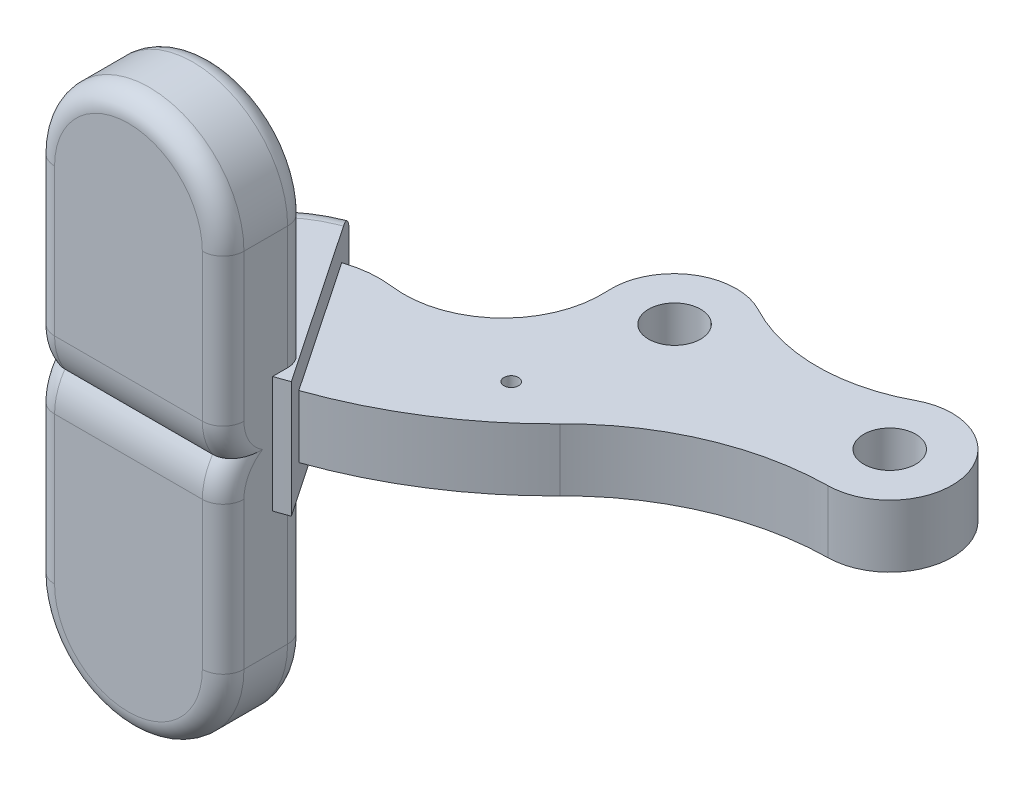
ISO-10303-21;
HEADER;
FILE_DESCRIPTION(('STEP AP214'),'2;1');
FILE_NAME('part.step','',(''),(''),'','','');
FILE_SCHEMA(('AUTOMOTIVE_DESIGN { 1 0 10303 214 1 1 1 1 }'));
ENDSEC;
DATA;
#1=APPLICATION_CONTEXT('core data for automotive mechanical design processes');
#2=APPLICATION_PROTOCOL_DEFINITION('international standard','automotive_design',2000,#1);
#3=PRODUCT_CONTEXT('',#1,'mechanical');
#4=PRODUCT('Part','Part','',(#3));
#5=PRODUCT_RELATED_PRODUCT_CATEGORY('part','',(#4));
#6=PRODUCT_DEFINITION_FORMATION('','',#4);
#7=PRODUCT_DEFINITION_CONTEXT('part definition',#1,'design');
#8=PRODUCT_DEFINITION('design','',#6,#7);
#9=PRODUCT_DEFINITION_SHAPE('','',#8);
#10=(LENGTH_UNIT() NAMED_UNIT(*) SI_UNIT(.MILLI.,.METRE.));
#11=(NAMED_UNIT(*) PLANE_ANGLE_UNIT() SI_UNIT($,.RADIAN.));
#12=(NAMED_UNIT(*) SI_UNIT($,.STERADIAN.) SOLID_ANGLE_UNIT());
#13=UNCERTAINTY_MEASURE_WITH_UNIT(LENGTH_MEASURE(1.E-05),#10,'distance_accuracy_value','');
#14=(GEOMETRIC_REPRESENTATION_CONTEXT(3) GLOBAL_UNCERTAINTY_ASSIGNED_CONTEXT((#13)) GLOBAL_UNIT_ASSIGNED_CONTEXT((#10,
#11,#12)) REPRESENTATION_CONTEXT('',''));
#15=CARTESIAN_POINT('',(0.,0.,0.));
#16=DIRECTION('',(0.,0.,1.));
#17=DIRECTION('',(1.,0.,0.));
#18=AXIS2_PLACEMENT_3D('',#15,#16,#17);
#19=CARTESIAN_POINT('',(-46.5719952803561,2.99999999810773,-14.2172446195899));
#20=DIRECTION('',(0.,-1.,0.));
#21=DIRECTION('',(0.999999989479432,0.,-0.000145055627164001));
#22=AXIS2_PLACEMENT_3D('',#19,#20,#21);
#23=CYLINDRICAL_SURFACE('',#22,42.6);
#24=CARTESIAN_POINT('',(-46.5719952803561,-5.60000000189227,-14.2172446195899));
#25=DIRECTION('',(0.,-1.,0.));
#26=DIRECTION('',(0.999999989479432,0.,-0.000145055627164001));
#27=AXIS2_PLACEMENT_3D('',#24,#25,#26);
#28=CIRCLE('',#27,42.6);
#29=CARTESIAN_POINT('',(-33.1170566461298,-5.6000000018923,26.2021149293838));
#30=VERTEX_POINT('',#29);
#31=CARTESIAN_POINT('',(-31.785820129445,-5.60000000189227,25.7343388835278));
#32=VERTEX_POINT('',#31);
#33=EDGE_CURVE('E678',#30,#32,#28,.F.);
#34=ORIENTED_EDGE('',*,*,#33,.T.);
#35=DIRECTION('',(0.,-1.,0.));
#36=VECTOR('',#35,1.);
#37=CARTESIAN_POINT('',(-31.7858201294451,2.99999999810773,25.7343388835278));
#38=LINE('',#37,#36);
#39=CARTESIAN_POINT('',(-31.7858201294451,5.59999999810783,25.7343388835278));
#40=VERTEX_POINT('',#39);
#41=EDGE_CURVE('E9',#32,#40,#38,.F.);
#42=ORIENTED_EDGE('',*,*,#41,.T.);
#43=CARTESIAN_POINT('',(-46.5719952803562,5.59999999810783,-14.2172446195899));
#44=DIRECTION('',(0.,-1.,0.));
#45=DIRECTION('',(0.999999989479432,0.,-0.000145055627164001));
#46=AXIS2_PLACEMENT_3D('',#43,#44,#45);
#47=CIRCLE('',#46,42.6);
#48=CARTESIAN_POINT('',(-33.1170566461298,5.59999999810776,26.2021149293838));
#49=VERTEX_POINT('',#48);
#50=EDGE_CURVE('E681',#40,#49,#47,.T.);
#51=ORIENTED_EDGE('',*,*,#50,.T.);
#52=DIRECTION('',(0.,-1.,0.));
#53=VECTOR('',#52,1.);
#54=CARTESIAN_POINT('',(-33.1170566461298,5.59999999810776,26.2021149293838));
#55=LINE('',#54,#53);
#56=EDGE_CURVE('E763',#49,#30,#55,.T.);
#57=ORIENTED_EDGE('',*,*,#56,.T.);
#58=EDGE_LOOP('',(#34,#42,#51,#57));
#59=FACE_BOUND('',#58,.T.);
#60=ADVANCED_FACE('F14',(#59),#23,.T.);
#61=CARTESIAN_POINT('',(-38.717913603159,5.59999999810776,20.2947391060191));
#62=DIRECTION('',(0.,1.,0.));
#63=DIRECTION('',(-0.999999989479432,0.,0.000145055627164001));
#64=AXIS2_PLACEMENT_3D('',#61,#62,#63);
#65=PLANE('',#64);
#66=ORIENTED_EDGE('',*,*,#50,.F.);
#67=DIRECTION('',(-0.559696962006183,0.,-0.828697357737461));
#68=VECTOR('',#67,1.);
#69=CARTESIAN_POINT('',(-36.4803643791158,5.59999999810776,18.7835124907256));
#70=LINE('',#69,#68);
#71=CARTESIAN_POINT('',(-42.2174511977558,5.59999999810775,10.2890788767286));
#72=VERTEX_POINT('',#71);
#73=EDGE_CURVE('E23',#40,#72,#70,.T.);
#74=ORIENTED_EDGE('',*,*,#73,.T.);
#75=CARTESIAN_POINT('',(-38.717913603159,5.59999999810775,20.2947391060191));
#76=DIRECTION('',(0.,1.,0.));
#77=DIRECTION('',(-1.,0.,0.));
#78=AXIS2_PLACEMENT_3D('',#75,#76,#77);
#79=CIRCLE('',#78,10.6);
#80=CARTESIAN_POINT('',(-42.6983049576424,5.59999999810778,10.4704587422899));
#81=VERTEX_POINT('',#80);
#82=EDGE_CURVE('E862',#81,#72,#79,.F.);
#83=ORIENTED_EDGE('',*,*,#82,.F.);
#84=CARTESIAN_POINT('',(-38.717913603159,5.59999999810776,20.2947391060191));
#85=DIRECTION('',(0.,-1.,0.));
#86=DIRECTION('',(-0.999999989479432,0.,0.000145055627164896));
#87=AXIS2_PLACEMENT_3D('',#84,#85,#86);
#88=CIRCLE('',#87,10.6);
#89=CARTESIAN_POINT('',(-49.3179134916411,5.59999999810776,20.296276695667));
#90=VERTEX_POINT('',#89);
#91=EDGE_CURVE('E517',#81,#90,#88,.F.);
#92=ORIENTED_EDGE('',*,*,#91,.T.);
#93=DIRECTION('',(-0.000145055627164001,0.,-0.999999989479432));
#94=VECTOR('',#93,1.);
#95=CARTESIAN_POINT('',(-49.3179134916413,5.59999999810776,20.296276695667));
#96=LINE('',#95,#94);
#97=CARTESIAN_POINT('',(-49.3175563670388,5.59999999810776,22.7582604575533));
#98=VERTEX_POINT('',#97);
#99=EDGE_CURVE('E781',#98,#90,#96,.T.);
#100=ORIENTED_EDGE('',*,*,#99,.F.);
#101=DIRECTION('',(-0.999999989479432,0.,0.000145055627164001));
#102=VECTOR('',#101,1.);
#103=CARTESIAN_POINT('',(-38.7175564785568,5.59999999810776,22.7567228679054));
#104=LINE('',#103,#102);
#105=CARTESIAN_POINT('',(-35.1175565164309,5.59999999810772,22.7562006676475));
#106=VERTEX_POINT('',#105);
#107=EDGE_CURVE('E490',#106,#98,#104,.T.);
#108=ORIENTED_EDGE('',*,*,#107,.F.);
#109=CARTESIAN_POINT('',(-35.1172664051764,5.59999999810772,24.7562006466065));
#110=DIRECTION('',(0.,1.,0.));
#111=DIRECTION('',(-0.000145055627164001,0.,-0.999999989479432));
#112=AXIS2_PLACEMENT_3D('',#109,#110,#111);
#113=CIRCLE('',#112,2.);
#114=CARTESIAN_POINT('',(-33.1172664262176,5.5999999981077,24.7559105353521));
#115=VERTEX_POINT('',#114);
#116=EDGE_CURVE('E808',#106,#115,#113,.F.);
#117=ORIENTED_EDGE('',*,*,#116,.T.);
#118=DIRECTION('',(0.000145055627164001,0.,0.999999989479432));
#119=VECTOR('',#118,1.);
#120=CARTESIAN_POINT('',(-33.1171793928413,5.5999999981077,25.3559105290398));
#121=LINE('',#120,#119);
#122=EDGE_CURVE('E974',#115,#49,#121,.T.);
#123=ORIENTED_EDGE('',*,*,#122,.T.);
#124=EDGE_LOOP('',(#66,#74,#83,#92,#100,#108,#117,#123));
#125=FACE_BOUND('',#124,.T.);
#126=ADVANCED_FACE('F502',(#125),#65,.T.);
#127=CARTESIAN_POINT('',(-33.3014177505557,-5.6000000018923,23.4903178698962));
#128=DIRECTION('',(0.,1.,0.));
#129=DIRECTION('',(-0.000145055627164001,0.,-0.999999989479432));
#130=AXIS2_PLACEMENT_3D('',#127,#128,#129);
#131=PLANE('',#130);
#132=DIRECTION('',(-0.559696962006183,0.,-0.828697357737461));
#133=VECTOR('',#132,1.);
#134=CARTESIAN_POINT('',(-33.3014177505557,-5.6000000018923,23.4903178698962));
#135=LINE('',#134,#133);
#136=CARTESIAN_POINT('',(-42.2174511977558,-5.60000000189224,10.2890788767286));
#137=VERTEX_POINT('',#136);
#138=EDGE_CURVE('E36',#32,#137,#135,.T.);
#139=ORIENTED_EDGE('',*,*,#138,.F.);
#140=ORIENTED_EDGE('',*,*,#33,.F.);
#141=DIRECTION('',(0.000145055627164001,0.,0.999999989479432));
#142=VECTOR('',#141,1.);
#143=CARTESIAN_POINT('',(-33.1167442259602,-5.6000000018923,28.3559104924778));
#144=LINE('',#143,#142);
#145=CARTESIAN_POINT('',(-33.117266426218,-5.6000000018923,24.7559105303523));
#146=VERTEX_POINT('',#145);
#147=EDGE_CURVE('E643',#30,#146,#144,.F.);
#148=ORIENTED_EDGE('',*,*,#147,.T.);
#149=CARTESIAN_POINT('',(-35.1172664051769,-5.60000000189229,24.7562006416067));
#150=DIRECTION('',(0.,1.,0.));
#151=DIRECTION('',(-0.000145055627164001,0.,-0.999999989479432));
#152=AXIS2_PLACEMENT_3D('',#149,#150,#151);
#153=CIRCLE('',#152,2.);
#154=CARTESIAN_POINT('',(-35.1175565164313,-5.60000000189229,22.7562006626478));
#155=VERTEX_POINT('',#154);
#156=EDGE_CURVE('E436',#155,#146,#153,.F.);
#157=ORIENTED_EDGE('',*,*,#156,.F.);
#158=DIRECTION('',(-0.999999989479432,0.,0.000145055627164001));
#159=VECTOR('',#158,1.);
#160=CARTESIAN_POINT('',(-33.3015242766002,-5.6000000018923,22.7559372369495));
#161=LINE('',#160,#159);
#162=CARTESIAN_POINT('',(-49.3175563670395,-5.60000000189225,22.7582604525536));
#163=VERTEX_POINT('',#162);
#164=EDGE_CURVE('E541',#163,#155,#161,.F.);
#165=ORIENTED_EDGE('',*,*,#164,.F.);
#166=DIRECTION('',(0.000145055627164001,0.,0.999999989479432));
#167=VECTOR('',#166,1.);
#168=CARTESIAN_POINT('',(-49.317179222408,-5.60000000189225,25.3582604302));
#169=LINE('',#168,#167);
#170=CARTESIAN_POINT('',(-49.3179134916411,-5.60000000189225,20.296276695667));
#171=VERTEX_POINT('',#170);
#172=EDGE_CURVE('E574',#171,#163,#169,.T.);
#173=ORIENTED_EDGE('',*,*,#172,.F.);
#174=CARTESIAN_POINT('',(-38.717913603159,-5.60000000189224,20.2947391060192));
#175=DIRECTION('',(0.,1.,0.));
#176=DIRECTION('',(-0.375508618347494,0.,-0.926818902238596));
#177=AXIS2_PLACEMENT_3D('',#174,#175,#176);
#178=CIRCLE('',#177,10.6000000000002);
#179=CARTESIAN_POINT('',(-42.6983049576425,-5.60000000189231,10.47045874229));
#180=VERTEX_POINT('',#179);
#181=EDGE_CURVE('E544',#180,#171,#178,.T.);
#182=ORIENTED_EDGE('',*,*,#181,.F.);
#183=CARTESIAN_POINT('',(-38.717913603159,-5.60000000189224,20.2947391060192));
#184=DIRECTION('',(0.,1.,0.));
#185=DIRECTION('',(-1.,0.,0.));
#186=AXIS2_PLACEMENT_3D('',#183,#184,#185);
#187=CIRCLE('',#186,10.6000000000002);
#188=EDGE_CURVE('E947',#180,#137,#187,.F.);
#189=ORIENTED_EDGE('',*,*,#188,.T.);
#190=EDGE_LOOP('',(#139,#140,#148,#157,#165,#173,#182,#189));
#191=FACE_BOUND('',#190,.T.);
#192=ADVANCED_FACE('F661',(#191),#131,.F.);
#193=CARTESIAN_POINT('',(-38.717913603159,-3.60000000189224,20.2947391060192));
#194=DIRECTION('',(0.,1.,0.));
#195=DIRECTION('',(-0.999999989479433,0.,0.000145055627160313));
#196=AXIS2_PLACEMENT_3D('',#193,#194,#195);
#197=TOROIDAL_SURFACE('',#196,10.6000000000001,2.);
#198=CARTESIAN_POINT('',(-38.717913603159,-3.60000000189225,20.2947391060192));
#199=DIRECTION('',(0.,-1.,0.));
#200=DIRECTION('',(0.999999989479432,0.,-0.000145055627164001));
#201=AXIS2_PLACEMENT_3D('',#198,#199,#200);
#202=CIRCLE('',#201,12.6);
#203=CARTESIAN_POINT('',(-43.3687213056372,-3.60000000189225,8.58448771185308));
#204=VERTEX_POINT('',#203);
#205=CARTESIAN_POINT('',(-51.3179134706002,-3.60000000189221,20.2965668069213));
#206=VERTEX_POINT('',#205);
#207=EDGE_CURVE('E701',#204,#206,#202,.F.);
#208=ORIENTED_EDGE('',*,*,#207,.F.);
#209=CARTESIAN_POINT('',(-43.3687213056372,-3.60000000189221,8.58448771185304));
#210=CARTESIAN_POINT('',(-43.3687214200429,-3.6552751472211,8.58448754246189));
#211=CARTESIAN_POINT('',(-43.3674074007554,-3.71052352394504,8.5864331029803));
#212=CARTESIAN_POINT('',(-43.3621674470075,-3.82061856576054,8.59419147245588));
#213=CARTESIAN_POINT('',(-43.3582417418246,-3.87546526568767,8.60000394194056));
#214=CARTESIAN_POINT('',(-43.3425945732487,-4.03865227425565,8.62317142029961));
#215=CARTESIAN_POINT('',(-43.3270028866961,-4.14588908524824,8.64625675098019));
#216=CARTESIAN_POINT('',(-43.2859820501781,-4.35414336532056,8.70699293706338));
#217=CARTESIAN_POINT('',(-43.260550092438,-4.45515904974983,8.74464794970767));
#218=CARTESIAN_POINT('',(-43.2006371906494,-4.64822918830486,8.83335606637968));
#219=CARTESIAN_POINT('',(-43.1661563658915,-4.74028376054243,8.88440899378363));
#220=CARTESIAN_POINT('',(-43.0888387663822,-4.91376047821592,8.9988868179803));
#221=CARTESIAN_POINT('',(-43.0459295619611,-4.99507944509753,9.06241895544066));
#222=CARTESIAN_POINT('',(-42.9532214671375,-5.14404047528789,9.19968422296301));
#223=CARTESIAN_POINT('',(-42.9034212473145,-5.21167989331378,9.27341932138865));
#224=CARTESIAN_POINT('',(-42.7971784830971,-5.33299192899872,9.43072426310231));
#225=CARTESIAN_POINT('',(-42.7406123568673,-5.38631859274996,9.51447708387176));
#226=CARTESIAN_POINT('',(-42.6233656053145,-5.4757458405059,9.68807472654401));
#227=CARTESIAN_POINT('',(-42.5626854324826,-5.51184831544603,9.77791887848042));
#228=CARTESIAN_POINT('',(-42.4544479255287,-5.55928278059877,9.93817727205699));
#229=CARTESIAN_POINT('',(-42.4074174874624,-5.57455683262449,10.0078113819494));
#230=CARTESIAN_POINT('',(-42.3127452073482,-5.59491527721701,10.1479848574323));
#231=CARTESIAN_POINT('',(-42.2651044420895,-5.60001564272,10.2185226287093));
#232=CARTESIAN_POINT('',(-42.2174511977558,-5.60000000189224,10.2890788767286));
#233=B_SPLINE_CURVE_WITH_KNOTS('',3,(#209,#210,#211,#212,#213,#214,#215,#216,#217,#218,#219,
#220,#221,#222,#223,#224,#225,#226,#227,#228,#229,#230,#231,#232),.UNSPECIFIED.,.F.,.F.,(4,2,2,
2,2,2,2,2,2,2,2,4),(0.,0.165722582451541,0.331430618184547,0.662107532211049,0.992878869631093,
1.32364584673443,1.65739054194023,1.99119971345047,2.33246968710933,2.67370218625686,
2.92932830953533,3.18455277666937),.UNSPECIFIED.);
#234=EDGE_CURVE('E688',#204,#137,#233,.T.);
#235=ORIENTED_EDGE('',*,*,#234,.T.);
#236=ORIENTED_EDGE('',*,*,#188,.F.);
#237=ORIENTED_EDGE('',*,*,#181,.T.);
#238=CARTESIAN_POINT('',(-49.3179134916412,-3.60000000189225,20.296276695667));
#239=DIRECTION('',(0.000145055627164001,0.,0.999999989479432));
#240=DIRECTION('',(0.999999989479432,0.,-0.000145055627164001));
#241=AXIS2_PLACEMENT_3D('',#238,#239,#240);
#242=CIRCLE('',#241,2.);
#243=EDGE_CURVE('E571',#206,#171,#242,.T.);
#244=ORIENTED_EDGE('',*,*,#243,.F.);
#245=EDGE_LOOP('',(#208,#235,#236,#237,#244));
#246=FACE_BOUND('',#245,.T.);
#247=ADVANCED_FACE('F532',(#246),#197,.T.);
#248=CARTESIAN_POINT('',(-38.717913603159,2.99999999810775,20.2947391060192));
#249=DIRECTION('',(0.,-1.,0.));
#250=DIRECTION('',(0.999999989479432,0.,-0.000145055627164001));
#251=AXIS2_PLACEMENT_3D('',#248,#249,#250);
#252=CYLINDRICAL_SURFACE('',#251,12.6);
#253=CARTESIAN_POINT('',(-38.717913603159,3.59999999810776,20.2947391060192));
#254=DIRECTION('',(0.,-1.,0.));
#255=DIRECTION('',(0.999999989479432,0.,-0.000145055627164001));
#256=AXIS2_PLACEMENT_3D('',#253,#254,#255);
#257=CIRCLE('',#256,12.6);
#258=CARTESIAN_POINT('',(-51.3179134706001,3.59999999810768,20.2965668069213));
#259=VERTEX_POINT('',#258);
#260=CARTESIAN_POINT('',(-43.3687213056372,3.59999999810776,8.58448771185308));
#261=VERTEX_POINT('',#260);
#262=EDGE_CURVE('E705',#259,#261,#257,.T.);
#263=ORIENTED_EDGE('',*,*,#262,.T.);
#264=DIRECTION('',(0.,-1.,0.));
#265=VECTOR('',#264,1.);
#266=CARTESIAN_POINT('',(-43.3687213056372,2.99999999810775,8.58448771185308));
#267=LINE('',#266,#265);
#268=EDGE_CURVE('E690',#261,#204,#267,.T.);
#269=ORIENTED_EDGE('',*,*,#268,.T.);
#270=ORIENTED_EDGE('',*,*,#207,.T.);
#271=DIRECTION('',(0.,1.,0.));
#272=VECTOR('',#271,1.);
#273=CARTESIAN_POINT('',(-51.3179134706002,-4.31087736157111,20.2965668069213));
#274=LINE('',#273,#272);
#275=EDGE_CURVE('E719',#206,#259,#274,.T.);
#276=ORIENTED_EDGE('',*,*,#275,.T.);
#277=EDGE_LOOP('',(#263,#269,#270,#276));
#278=FACE_BOUND('',#277,.T.);
#279=ADVANCED_FACE('F531',(#278),#252,.T.);
#280=CARTESIAN_POINT('',(-38.717913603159,3.59999999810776,20.2947391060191));
#281=DIRECTION('',(0.,1.,0.));
#282=DIRECTION('',(-0.999999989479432,0.,0.000145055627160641));
#283=AXIS2_PLACEMENT_3D('',#280,#281,#282);
#284=TOROIDAL_SURFACE('',#283,10.6,2.);
#285=ORIENTED_EDGE('',*,*,#82,.T.);
#286=CARTESIAN_POINT('',(-42.2174511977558,5.59999999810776,10.2890788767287));
#287=CARTESIAN_POINT('',(-42.2506055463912,5.59999570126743,10.2399899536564));
#288=CARTESIAN_POINT('',(-42.2837390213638,5.59753658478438,10.1909319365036));
#289=CARTESIAN_POINT('',(-42.3497764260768,5.58770067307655,10.0931557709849));
#290=CARTESIAN_POINT('',(-42.382680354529,5.58032385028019,10.0444376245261));
#291=CARTESIAN_POINT('',(-42.4807311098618,5.55081517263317,9.8992619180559));
#292=CARTESIAN_POINT('',(-42.5452522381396,5.52130511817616,9.80373077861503));
#293=CARTESIAN_POINT('',(-42.639188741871,5.46280969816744,9.66464670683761));
#294=CARTESIAN_POINT('',(-42.6700571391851,5.44090948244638,9.61894240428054));
#295=CARTESIAN_POINT('',(-42.730638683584,5.39247886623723,9.52924428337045));
#296=CARTESIAN_POINT('',(-42.7603521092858,5.36594959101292,9.48525005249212));
#297=CARTESIAN_POINT('',(-42.8183632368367,5.30844643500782,9.39935773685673));
#298=CARTESIAN_POINT('',(-42.8466622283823,5.2774767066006,9.35745774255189));
#299=CARTESIAN_POINT('',(-42.9016779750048,5.21125261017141,9.27600044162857));
#300=CARTESIAN_POINT('',(-42.9283930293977,5.17599375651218,9.23644565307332));
#301=CARTESIAN_POINT('',(-43.0047642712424,5.06564707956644,9.12336902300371));
#302=CARTESIAN_POINT('',(-43.0518645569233,4.98477752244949,9.05363149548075));
#303=CARTESIAN_POINT('',(-43.137520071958,4.80970142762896,8.92680840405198));
#304=CARTESIAN_POINT('',(-43.1760774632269,4.7154982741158,8.86971963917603));
#305=CARTESIAN_POINT('',(-43.2261028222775,4.56767112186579,8.795651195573));
#306=CARTESIAN_POINT('',(-43.2413256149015,4.51799859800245,8.7731120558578));
#307=CARTESIAN_POINT('',(-43.2693235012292,4.4165351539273,8.7316578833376));
#308=CARTESIAN_POINT('',(-43.282100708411,4.36474611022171,8.71273972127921));
#309=CARTESIAN_POINT('',(-43.3051068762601,4.25942193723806,8.67867637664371));
#310=CARTESIAN_POINT('',(-43.3153369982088,4.20588761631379,8.66352947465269));
#311=CARTESIAN_POINT('',(-43.3331736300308,4.09744821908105,8.63712023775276));
#312=CARTESIAN_POINT('',(-43.3407804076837,4.0425432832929,8.62585750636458));
#313=CARTESIAN_POINT('',(-43.3542470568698,3.92343670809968,8.60591854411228));
#314=CARTESIAN_POINT('',(-43.3596730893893,3.85907708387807,8.59788466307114));
#315=CARTESIAN_POINT('',(-43.3669113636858,3.72981019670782,8.58716754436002));
#316=CARTESIAN_POINT('',(-43.3687289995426,3.66490389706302,8.58447632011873));
#317=CARTESIAN_POINT('',(-43.3687213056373,3.59999999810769,8.58448771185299));
#318=B_SPLINE_CURVE_WITH_KNOTS('',3,(#286,#287,#288,#289,#290,#291,#292,#293,#294,#295,#296,
#297,#298,#299,#300,#301,#302,#303,#304,#305,#306,#307,#308,#309,#310,#311,#312,#313,#314,#315,
#316,#317),.UNSPECIFIED.,.F.,.F.,(4,2,2,2,2,2,2,2,2,2,2,2,2,2,2,4),(0.,0.177582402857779,
0.355165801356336,0.710145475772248,0.88800334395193,1.06581803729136,1.24346752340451,
1.42130442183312,1.76960593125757,2.11781919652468,2.28754054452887,2.45711455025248,
2.62661110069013,2.7960903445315,2.99101883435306,3.18565571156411),.UNSPECIFIED.);
#319=EDGE_CURVE('E694',#72,#261,#318,.T.);
#320=ORIENTED_EDGE('',*,*,#319,.T.);
#321=ORIENTED_EDGE('',*,*,#262,.F.);
#322=CARTESIAN_POINT('',(-49.3179134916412,3.59999999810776,20.296276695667));
#323=DIRECTION('',(-0.000145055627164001,0.,-0.999999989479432));
#324=DIRECTION('',(-0.999999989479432,0.,0.000145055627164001));
#325=AXIS2_PLACEMENT_3D('',#322,#323,#324);
#326=CIRCLE('',#325,2.);
#327=EDGE_CURVE('E704',#90,#259,#326,.F.);
#328=ORIENTED_EDGE('',*,*,#327,.F.);
#329=ORIENTED_EDGE('',*,*,#91,.F.);
#330=EDGE_LOOP('',(#285,#320,#321,#328,#329));
#331=FACE_BOUND('',#330,.T.);
#332=ADVANCED_FACE('F522',(#331),#284,.T.);
#333=CARTESIAN_POINT('',(-38.7163670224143,4.31087735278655,30.9567227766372));
#334=DIRECTION('',(0.000145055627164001,0.,0.999999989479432));
#335=DIRECTION('',(0.,1.,0.));
#336=AXIS2_PLACEMENT_3D('',#333,#334,#335);
#337=PLANE('',#336);
#338=DIRECTION('',(-0.999999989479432,0.,0.000145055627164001));
#339=VECTOR('',#338,1.);
#340=CARTESIAN_POINT('',(-38.7163670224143,-3.25000000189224,30.9567227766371));
#341=LINE('',#340,#339);
#342=CARTESIAN_POINT('',(-35.1163670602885,-3.25000000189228,30.9562005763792));
#343=VERTEX_POINT('',#342);
#344=CARTESIAN_POINT('',(-49.3163669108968,-3.25000000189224,30.958260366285));
#345=VERTEX_POINT('',#344);
#346=EDGE_CURVE('E273',#343,#345,#341,.T.);
#347=ORIENTED_EDGE('',*,*,#346,.T.);
#348=DIRECTION('',(0.,1.,0.));
#349=VECTOR('',#348,1.);
#350=CARTESIAN_POINT('',(-49.3163669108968,4.31087735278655,30.958260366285));
#351=LINE('',#350,#349);
#352=CARTESIAN_POINT('',(-49.3163669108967,-17.4000000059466,30.9582603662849));
#353=VERTEX_POINT('',#352);
#354=EDGE_CURVE('E265',#345,#353,#351,.F.);
#355=ORIENTED_EDGE('',*,*,#354,.T.);
#356=CARTESIAN_POINT('',(-42.2163669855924,-17.4000000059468,30.957230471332));
#357=DIRECTION('',(-0.000145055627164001,0.,-0.999999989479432));
#358=DIRECTION('',(0.999999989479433,0.,-0.000145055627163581));
#359=AXIS2_PLACEMENT_3D('',#356,#357,#358);
#360=CIRCLE('',#359,7.10000000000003);
#361=CARTESIAN_POINT('',(-35.1163670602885,-17.4000000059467,30.9562005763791));
#362=VERTEX_POINT('',#361);
#363=EDGE_CURVE('E242',#353,#362,#360,.F.);
#364=ORIENTED_EDGE('',*,*,#363,.T.);
#365=DIRECTION('',(0.,1.,0.));
#366=VECTOR('',#365,1.);
#367=CARTESIAN_POINT('',(-35.1163670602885,4.31087735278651,30.9562005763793));
#368=LINE('',#367,#366);
#369=EDGE_CURVE('E256',#362,#343,#368,.T.);
#370=ORIENTED_EDGE('',*,*,#369,.T.);
#371=EDGE_LOOP('',(#347,#355,#364,#370));
#372=FACE_BOUND('',#371,.T.);
#373=ADVANCED_FACE('F271',(#372),#337,.T.);
#374=CARTESIAN_POINT('',(-42.2166570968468,-17.4000000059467,28.9572304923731));
#375=DIRECTION('',(0.000145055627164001,0.,0.999999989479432));
#376=DIRECTION('',(0.,1.,0.));
#377=AXIS2_PLACEMENT_3D('',#374,#375,#376);
#378=TOROIDAL_SURFACE('',#377,7.10000000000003,2.);
#379=CARTESIAN_POINT('',(-49.3166570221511,-17.4000000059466,28.9582603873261));
#380=DIRECTION('',(0.,1.,0.));
#381=DIRECTION('',(-0.000145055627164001,0.,-0.999999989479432));
#382=AXIS2_PLACEMENT_3D('',#379,#380,#381);
#383=CIRCLE('',#382,2.);
#384=CARTESIAN_POINT('',(-51.3166570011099,-17.4000000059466,28.9585504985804));
#385=VERTEX_POINT('',#384);
#386=EDGE_CURVE('E247',#385,#353,#383,.T.);
#387=ORIENTED_EDGE('',*,*,#386,.F.);
#388=CARTESIAN_POINT('',(-42.2166570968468,-17.4000000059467,28.9572304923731));
#389=DIRECTION('',(0.000145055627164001,0.,0.999999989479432));
#390=DIRECTION('',(0.,1.,0.));
#391=AXIS2_PLACEMENT_3D('',#388,#389,#390);
#392=CIRCLE('',#391,9.1);
#393=CARTESIAN_POINT('',(-33.1166571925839,-17.4000000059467,28.9559104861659));
#394=VERTEX_POINT('',#393);
#395=EDGE_CURVE('E314',#385,#394,#392,.T.);
#396=ORIENTED_EDGE('',*,*,#395,.T.);
#397=CARTESIAN_POINT('',(-35.1166571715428,-17.4000000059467,28.9562005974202));
#398=DIRECTION('',(0.,-1.,0.));
#399=DIRECTION('',(0.000145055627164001,0.,0.999999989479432));
#400=AXIS2_PLACEMENT_3D('',#397,#398,#399);
#401=CIRCLE('',#400,2.);
#402=EDGE_CURVE('E250',#362,#394,#401,.F.);
#403=ORIENTED_EDGE('',*,*,#402,.F.);
#404=ORIENTED_EDGE('',*,*,#363,.F.);
#405=EDGE_LOOP('',(#387,#396,#403,#404));
#406=FACE_BOUND('',#405,.T.);
#407=ADVANCED_FACE('F245',(#406),#378,.T.);
#408=CARTESIAN_POINT('',(-55.8902538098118,-3.25000000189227,25.1092138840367));
#409=DIRECTION('',(0.999999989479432,0.,-0.000145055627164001));
#410=DIRECTION('',(0.,1.,0.));
#411=AXIS2_PLACEMENT_3D('',#408,#409,#410);
#412=CYLINDRICAL_SURFACE('',#411,5.85);
#413=ORIENTED_EDGE('',*,*,#346,.F.);
#414=CARTESIAN_POINT('',(-35.1172156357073,-3.25000000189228,25.1062006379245));
#415=DIRECTION('',(0.999999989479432,0.,-0.000145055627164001));
#416=DIRECTION('',(0.,1.,0.));
#417=AXIS2_PLACEMENT_3D('',#414,#415,#416);
#418=CIRCLE('',#417,5.85);
#419=CARTESIAN_POINT('',(-35.1165100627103,-5.63379985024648E-09,29.9703551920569));
#420=VERTEX_POINT('',#419);
#421=EDGE_CURVE('E269',#343,#420,#418,.F.);
#422=ORIENTED_EDGE('',*,*,#421,.T.);
#423=DIRECTION('',(0.999999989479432,0.,-0.000145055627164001));
#424=VECTOR('',#423,1.);
#425=CARTESIAN_POINT('',(-55.8895482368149,-5.63378597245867E-09,29.9733684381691));
#426=LINE('',#425,#424);
#427=CARTESIAN_POINT('',(-49.3165099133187,-5.63385536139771E-09,29.9724149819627));
#428=VERTEX_POINT('',#427);
#429=EDGE_CURVE('E300',#420,#428,#426,.F.);
#430=ORIENTED_EDGE('',*,*,#429,.T.);
#431=CARTESIAN_POINT('',(-49.3172154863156,-3.25000000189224,25.1082604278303));
#432=DIRECTION('',(0.999999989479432,0.,-0.000145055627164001));
#433=DIRECTION('',(0.,1.,0.));
#434=AXIS2_PLACEMENT_3D('',#431,#432,#433);
#435=CIRCLE('',#434,5.85);
#436=EDGE_CURVE('E297',#428,#345,#435,.T.);
#437=ORIENTED_EDGE('',*,*,#436,.T.);
#438=EDGE_LOOP('',(#413,#422,#430,#437));
#439=FACE_BOUND('',#438,.T.);
#440=ADVANCED_FACE('F322',(#439),#412,.T.);
#441=CARTESIAN_POINT('',(-55.8902538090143,3.24999999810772,25.1092138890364));
#442=DIRECTION('',(0.999999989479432,0.,-0.000145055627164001));
#443=DIRECTION('',(-0.000145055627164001,0.,-0.999999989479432));
#444=AXIS2_PLACEMENT_3D('',#441,#442,#443);
#445=CYLINDRICAL_SURFACE('',#444,5.85);
#446=ORIENTED_EDGE('',*,*,#429,.F.);
#447=CARTESIAN_POINT('',(-35.1172156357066,3.24999999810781,25.1062006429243));
#448=DIRECTION('',(0.999999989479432,0.,-0.000145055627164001));
#449=DIRECTION('',(-0.000145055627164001,0.,-0.999999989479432));
#450=AXIS2_PLACEMENT_3D('',#447,#448,#449);
#451=CIRCLE('',#450,5.85);
#452=CARTESIAN_POINT('',(-35.1163670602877,3.24999999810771,30.956200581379));
#453=VERTEX_POINT('',#452);
#454=EDGE_CURVE('E753',#420,#453,#451,.F.);
#455=ORIENTED_EDGE('',*,*,#454,.T.);
#456=DIRECTION('',(0.999999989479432,0.,-0.000145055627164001));
#457=VECTOR('',#456,1.);
#458=CARTESIAN_POINT('',(-55.8894052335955,3.24999999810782,30.9592138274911));
#459=LINE('',#458,#457);
#460=CARTESIAN_POINT('',(-49.316366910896,3.24999999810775,30.9582603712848));
#461=VERTEX_POINT('',#460);
#462=EDGE_CURVE('E639',#453,#461,#459,.F.);
#463=ORIENTED_EDGE('',*,*,#462,.T.);
#464=CARTESIAN_POINT('',(-49.3172154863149,3.24999999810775,25.1082604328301));
#465=DIRECTION('',(0.999999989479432,0.,-0.000145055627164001));
#466=DIRECTION('',(-0.000145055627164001,0.,-0.999999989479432));
#467=AXIS2_PLACEMENT_3D('',#464,#465,#466);
#468=CIRCLE('',#467,5.85);
#469=EDGE_CURVE('E642',#461,#428,#468,.T.);
#470=ORIENTED_EDGE('',*,*,#469,.T.);
#471=EDGE_LOOP('',(#446,#455,#463,#470));
#472=FACE_BOUND('',#471,.T.);
#473=ADVANCED_FACE('F660',(#472),#445,.T.);
#474=CARTESIAN_POINT('',(-38.7163670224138,-4.31087736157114,30.9567227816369));
#475=DIRECTION('',(-0.000145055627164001,0.,-0.999999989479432));
#476=DIRECTION('',(0.,-1.,0.));
#477=AXIS2_PLACEMENT_3D('',#474,#475,#476);
#478=PLANE('',#477);
#479=DIRECTION('',(0.,-1.,0.));
#480=VECTOR('',#479,1.);
#481=CARTESIAN_POINT('',(-35.1163670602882,-4.31087736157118,30.9562005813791));
#482=LINE('',#481,#480);
#483=CARTESIAN_POINT('',(-35.1163670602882,17.3999999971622,30.956200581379));
#484=VERTEX_POINT('',#483);
#485=EDGE_CURVE('E626',#484,#453,#482,.T.);
#486=ORIENTED_EDGE('',*,*,#485,.F.);
#487=CARTESIAN_POINT('',(-42.2163669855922,17.3999999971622,30.9572304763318));
#488=DIRECTION('',(-0.000145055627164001,0.,-0.999999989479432));
#489=DIRECTION('',(-0.999999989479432,0.,0.00014505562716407));
#490=AXIS2_PLACEMENT_3D('',#487,#488,#489);
#491=CIRCLE('',#490,7.10000000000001);
#492=CARTESIAN_POINT('',(-49.3163669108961,17.3999999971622,30.9582603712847));
#493=VERTEX_POINT('',#492);
#494=EDGE_CURVE('E630',#493,#484,#491,.T.);
#495=ORIENTED_EDGE('',*,*,#494,.F.);
#496=DIRECTION('',(0.,1.,0.));
#497=VECTOR('',#496,1.);
#498=CARTESIAN_POINT('',(-49.3163669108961,-4.31087736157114,30.9582603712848));
#499=LINE('',#498,#497);
#500=EDGE_CURVE('E391',#461,#493,#499,.T.);
#501=ORIENTED_EDGE('',*,*,#500,.F.);
#502=ORIENTED_EDGE('',*,*,#462,.F.);
#503=EDGE_LOOP('',(#486,#495,#501,#502));
#504=FACE_BOUND('',#503,.T.);
#505=ADVANCED_FACE('F414',(#504),#478,.F.);
#506=CARTESIAN_POINT('',(-42.2166570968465,17.3999999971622,28.9572304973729));
#507=DIRECTION('',(-0.000145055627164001,0.,-0.999999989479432));
#508=DIRECTION('',(0.,-1.,0.));
#509=AXIS2_PLACEMENT_3D('',#506,#507,#508);
#510=TOROIDAL_SURFACE('',#509,7.10000000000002,2.);
#511=CARTESIAN_POINT('',(-49.3166570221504,17.3999999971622,28.9582603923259));
#512=DIRECTION('',(0.,1.,0.));
#513=DIRECTION('',(-0.000145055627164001,0.,-0.999999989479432));
#514=AXIS2_PLACEMENT_3D('',#511,#512,#513);
#515=CIRCLE('',#514,2.);
#516=CARTESIAN_POINT('',(-51.3166570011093,17.3999999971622,28.9585505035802));
#517=VERTEX_POINT('',#516);
#518=EDGE_CURVE('E597',#493,#517,#515,.F.);
#519=ORIENTED_EDGE('',*,*,#518,.F.);
#520=ORIENTED_EDGE('',*,*,#494,.T.);
#521=CARTESIAN_POINT('',(-35.1166571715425,17.3999999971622,28.9562006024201));
#522=DIRECTION('',(0.,-1.,0.));
#523=DIRECTION('',(0.999999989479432,0.,-0.000145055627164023));
#524=AXIS2_PLACEMENT_3D('',#521,#522,#523);
#525=CIRCLE('',#524,2.);
#526=CARTESIAN_POINT('',(-33.1166571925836,17.3999999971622,28.9559104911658));
#527=VERTEX_POINT('',#526);
#528=EDGE_CURVE('E545',#484,#527,#525,.F.);
#529=ORIENTED_EDGE('',*,*,#528,.T.);
#530=CARTESIAN_POINT('',(-42.2166570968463,17.3999999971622,28.9572304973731));
#531=DIRECTION('',(0.000145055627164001,0.,0.999999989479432));
#532=DIRECTION('',(0.,1.,0.));
#533=AXIS2_PLACEMENT_3D('',#530,#531,#532);
#534=CIRCLE('',#533,9.1);
#535=EDGE_CURVE('E610',#517,#527,#534,.F.);
#536=ORIENTED_EDGE('',*,*,#535,.F.);
#537=EDGE_LOOP('',(#519,#520,#529,#536));
#538=FACE_BOUND('',#537,.T.);
#539=ADVANCED_FACE('F408',(#538),#510,.T.);
#540=CARTESIAN_POINT('',(-49.3172662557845,-4.31087736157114,24.7582604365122));
#541=DIRECTION('',(0.,-1.,0.));
#542=DIRECTION('',(0.000145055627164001,0.,0.999999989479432));
#543=AXIS2_PLACEMENT_3D('',#540,#541,#542);
#544=CYLINDRICAL_SURFACE('',#543,2.);
#545=CARTESIAN_POINT('',(-49.3172662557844,3.59999999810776,24.7582604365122));
#546=DIRECTION('',(-0.000102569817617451,-0.707106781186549,-0.707106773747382));
#547=DIRECTION('',(-0.000102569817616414,0.707106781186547,-0.707106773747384));
#548=AXIS2_PLACEMENT_3D('',#545,#546,#547);
#549=ELLIPSE('',#548,2.8284271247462,2.);
#550=CARTESIAN_POINT('',(-51.3172662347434,3.59999999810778,24.7585505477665));
#551=VERTEX_POINT('',#550);
#552=EDGE_CURVE('E585',#98,#551,#549,.F.);
#553=ORIENTED_EDGE('',*,*,#552,.T.);
#554=DIRECTION('',(0.,1.,0.));
#555=VECTOR('',#554,1.);
#556=CARTESIAN_POINT('',(-51.3172662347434,-4.31087736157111,24.7585505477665));
#557=LINE('',#556,#555);
#558=CARTESIAN_POINT('',(-51.3172662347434,17.3999999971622,24.7585505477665));
#559=VERTEX_POINT('',#558);
#560=EDGE_CURVE('E772',#551,#559,#557,.T.);
#561=ORIENTED_EDGE('',*,*,#560,.T.);
#562=CARTESIAN_POINT('',(-49.3172662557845,17.3999999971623,24.7582604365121));
#563=DIRECTION('',(0.,-1.,0.));
#564=DIRECTION('',(0.000145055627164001,0.,0.999999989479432));
#565=AXIS2_PLACEMENT_3D('',#562,#563,#564);
#566=CIRCLE('',#565,2.);
#567=CARTESIAN_POINT('',(-49.3175563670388,17.3999999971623,22.7582604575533));
#568=VERTEX_POINT('',#567);
#569=EDGE_CURVE('E767',#559,#568,#566,.T.);
#570=ORIENTED_EDGE('',*,*,#569,.T.);
#571=DIRECTION('',(0.,-1.,0.));
#572=VECTOR('',#571,1.);
#573=CARTESIAN_POINT('',(-49.3175563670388,-4.31087736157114,22.7582604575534));
#574=LINE('',#573,#572);
#575=EDGE_CURVE('E764',#568,#98,#574,.T.);
#576=ORIENTED_EDGE('',*,*,#575,.T.);
#577=EDGE_LOOP('',(#553,#561,#570,#576));
#578=FACE_BOUND('',#577,.T.);
#579=ADVANCED_FACE('F413',(#578),#544,.T.);
#580=CARTESIAN_POINT('',(-49.3166570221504,-4.31087736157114,28.958260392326));
#581=DIRECTION('',(0.,1.,0.));
#582=DIRECTION('',(-0.000145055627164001,0.,-0.999999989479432));
#583=AXIS2_PLACEMENT_3D('',#580,#581,#582);
#584=CYLINDRICAL_SURFACE('',#583,2.);
#585=CARTESIAN_POINT('',(-49.3166570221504,3.24999999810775,28.958260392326));
#586=DIRECTION('',(0.,1.,0.));
#587=DIRECTION('',(-0.000145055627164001,0.,-0.999999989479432));
#588=AXIS2_PLACEMENT_3D('',#585,#586,#587);
#589=CIRCLE('',#588,2.);
#590=CARTESIAN_POINT('',(-51.3166570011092,3.24999999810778,28.9585505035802));
#591=VERTEX_POINT('',#590);
#592=EDGE_CURVE('E400',#591,#461,#589,.T.);
#593=ORIENTED_EDGE('',*,*,#592,.T.);
#594=ORIENTED_EDGE('',*,*,#500,.T.);
#595=ORIENTED_EDGE('',*,*,#518,.T.);
#596=DIRECTION('',(0.,1.,0.));
#597=VECTOR('',#596,1.);
#598=CARTESIAN_POINT('',(-51.3166570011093,-4.31087736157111,28.9585505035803));
#599=LINE('',#598,#597);
#600=EDGE_CURVE('E588',#517,#591,#599,.F.);
#601=ORIENTED_EDGE('',*,*,#600,.T.);
#602=EDGE_LOOP('',(#593,#594,#595,#601));
#603=FACE_BOUND('',#602,.T.);
#604=ADVANCED_FACE('F373',(#603),#584,.T.);
#605=CARTESIAN_POINT('',(-49.3172154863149,3.24999999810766,25.1082604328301));
#606=DIRECTION('',(0.999999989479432,0.,-0.000145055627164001));
#607=DIRECTION('',(-0.000145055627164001,0.,-0.999999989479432));
#608=AXIS2_PLACEMENT_3D('',#605,#606,#607);
#609=TOROIDAL_SURFACE('',#608,3.84999999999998,2.);
#610=ORIENTED_EDGE('',*,*,#592,.F.);
#611=CARTESIAN_POINT('',(-51.3172154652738,3.24999999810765,25.1085505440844));
#612=DIRECTION('',(0.999999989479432,0.,-0.000145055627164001));
#613=DIRECTION('',(0.000145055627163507,0.,0.999999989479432));
#614=AXIS2_PLACEMENT_3D('',#611,#612,#613);
#615=CIRCLE('',#614,3.84999999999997);
#616=CARTESIAN_POINT('',(-51.3169160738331,-3.47992554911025E-09,27.1725272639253));
#617=VERTEX_POINT('',#616);
#618=EDGE_CURVE('E399',#591,#617,#615,.T.);
#619=ORIENTED_EDGE('',*,*,#618,.T.);
#620=CARTESIAN_POINT('',(-49.3165099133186,-5.63375951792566E-09,29.9724149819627));
#621=CARTESIAN_POINT('',(-49.3434869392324,-2.36773726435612E-07,29.9724199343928));
#622=CARTESIAN_POINT('',(-49.3704641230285,-8.04690970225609E-06,29.9717717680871));
#623=CARTESIAN_POINT('',(-49.4242514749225,-3.23561266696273E-05,29.9691762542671));
#624=CARTESIAN_POINT('',(-49.4510618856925,-4.8821539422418E-05,29.9672339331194));
#625=CARTESIAN_POINT('',(-49.5044729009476,-8.40172223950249E-05,29.9620653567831));
#626=CARTESIAN_POINT('',(-49.5310739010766,-0.000102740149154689,29.9588431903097));
#627=CARTESIAN_POINT('',(-49.5840246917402,-0.00013783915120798,29.9511336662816));
#628=CARTESIAN_POINT('',(-49.6103749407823,-0.000154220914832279,29.9466494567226));
#629=CARTESIAN_POINT('',(-49.6627842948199,-0.000181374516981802,29.936436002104));
#630=CARTESIAN_POINT('',(-49.688843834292,-0.000192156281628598,29.9307089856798));
#631=CARTESIAN_POINT('',(-49.7406333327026,-0.000206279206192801,29.9180318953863));
#632=CARTESIAN_POINT('',(-49.766363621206,-0.000209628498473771,29.91108316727));
#633=CARTESIAN_POINT('',(-49.8174577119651,-0.000208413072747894,29.8959862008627));
#634=CARTESIAN_POINT('',(-49.8428216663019,-0.000203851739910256,29.8878384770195));
#635=CARTESIAN_POINT('',(-49.8931477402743,-0.000187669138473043,29.8703685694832));
#636=CARTESIAN_POINT('',(-49.9181097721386,-0.000176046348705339,29.8610461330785));
#637=CARTESIAN_POINT('',(-49.9675982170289,-0.000147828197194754,29.8412532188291));
#638=CARTESIAN_POINT('',(-49.9921242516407,-0.000131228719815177,29.8307817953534));
#639=CARTESIAN_POINT('',(-50.040708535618,-9.64589184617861E-05,29.8087186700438));
#640=CARTESIAN_POINT('',(-50.0647660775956,-7.82864152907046E-05,29.7971254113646));
#641=CARTESIAN_POINT('',(-50.1123826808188,-4.4496786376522E-05,29.7728473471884));
#642=CARTESIAN_POINT('',(-50.1359406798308,-2.88847070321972E-05,29.7601604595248));
#643=CARTESIAN_POINT('',(-50.1825295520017,-6.96151871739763E-06,29.7337257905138));
#644=CARTESIAN_POINT('',(-50.205558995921,-6.73237913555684E-07,29.7199754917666));
#645=CARTESIAN_POINT('',(-50.2511947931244,6.68217446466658E-07,29.6913593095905));
#646=CARTESIAN_POINT('',(-50.2737956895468,-4.37728160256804E-06,29.6764847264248));
#647=CARTESIAN_POINT('',(-50.3182639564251,-1.73253586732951E-05,29.6458125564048));
#648=CARTESIAN_POINT('',(-50.3401332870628,-2.52194982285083E-05,29.6300178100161));
#649=CARTESIAN_POINT('',(-50.3831242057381,-4.20253726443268E-05,29.5975516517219));
#650=CARTESIAN_POINT('',(-50.4042475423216,-5.09344878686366E-05,29.5808825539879));
#651=CARTESIAN_POINT('',(-50.4457343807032,-6.72239533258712E-05,29.5467128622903));
#652=CARTESIAN_POINT('',(-50.4660994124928,-7.46075358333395E-05,29.5292141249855));
#653=CARTESIAN_POINT('',(-50.5060602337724,-8.65113980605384E-05,29.4934300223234));
#654=CARTESIAN_POINT('',(-50.5256573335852,-9.10367738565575E-05,29.4751461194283));
#655=CARTESIAN_POINT('',(-50.5640752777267,-9.65015455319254E-05,29.4378358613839));
#656=CARTESIAN_POINT('',(-50.5828972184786,-9.74461914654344E-05,29.4188106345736));
#657=CARTESIAN_POINT('',(-50.6197601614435,-9.57149222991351E-05,29.3800611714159));
#658=CARTESIAN_POINT('',(-50.6378020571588,-9.30432693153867E-05,29.360337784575));
#659=CARTESIAN_POINT('',(-50.6731024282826,-8.46223738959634E-05,29.3202345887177));
#660=CARTESIAN_POINT('',(-50.6903616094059,-7.88759660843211E-05,29.2998554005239));
#661=CARTESIAN_POINT('',(-50.7240961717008,-6.54010834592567E-05,29.2584822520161));
#662=CARTESIAN_POINT('',(-50.740572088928,-5.76739880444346E-05,29.2374887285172));
#663=CARTESIAN_POINT('',(-50.7727416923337,-4.17201384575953E-05,29.1949275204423));
#664=CARTESIAN_POINT('',(-50.7884357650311,-3.34936357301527E-05,29.173360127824));
#665=CARTESIAN_POINT('',(-50.8190452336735,-1.8738796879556E-05,29.1296907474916));
#666=CARTESIAN_POINT('',(-50.8339608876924,-1.22098950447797E-05,29.1075889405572));
#667=CARTESIAN_POINT('',(-50.863018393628,-2.27630292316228E-06,29.0628889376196));
#668=CARTESIAN_POINT('',(-50.8771603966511,1.12899951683E-06,29.0402908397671));
#669=CARTESIAN_POINT('',(-50.9051010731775,-1.17350353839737E-06,28.9939353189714));
#670=CARTESIAN_POINT('',(-50.9188759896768,-7.1634290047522E-06,28.9701635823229));
#671=CARTESIAN_POINT('',(-50.9455780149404,-2.92618412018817E-05,28.9222478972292));
#672=CARTESIAN_POINT('',(-50.9585076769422,-4.53381370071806E-05,28.8981053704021));
#673=CARTESIAN_POINT('',(-50.9835357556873,-8.3980430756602E-05,28.8494875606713));
#674=CARTESIAN_POINT('',(-50.9956366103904,-0.000106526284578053,28.8250135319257));
#675=CARTESIAN_POINT('',(-51.0190255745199,-0.000155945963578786,28.7757704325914));
#676=CARTESIAN_POINT('',(-51.0303160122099,-0.000182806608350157,28.751002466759));
#677=CARTESIAN_POINT('',(-51.0521040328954,-0.000238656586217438,28.7012066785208));
#678=CARTESIAN_POINT('',(-51.0626038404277,-0.000267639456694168,28.6761798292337));
#679=CARTESIAN_POINT('',(-51.0828314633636,-0.000325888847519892,28.6259004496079));
#680=CARTESIAN_POINT('',(-51.0925614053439,-0.000355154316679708,28.600648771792));
#681=CARTESIAN_POINT('',(-51.1205871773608,-0.000440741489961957,28.5247074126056));
#682=CARTESIAN_POINT('',(-51.1378115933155,-0.000495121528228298,28.4736184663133));
#683=CARTESIAN_POINT('',(-51.1694407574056,-0.000587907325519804,28.3708857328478));
#684=CARTESIAN_POINT('',(-51.1838602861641,-0.000626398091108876,28.3192464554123));
#685=CARTESIAN_POINT('',(-51.2100825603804,-0.000680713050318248,28.2155988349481));
#686=CARTESIAN_POINT('',(-51.2218986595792,-0.000696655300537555,28.1635938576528));
#687=CARTESIAN_POINT('',(-51.2431221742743,-0.000702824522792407,28.0593731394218));
#688=CARTESIAN_POINT('',(-51.2525415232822,-0.000693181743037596,28.0071598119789));
#689=CARTESIAN_POINT('',(-51.2691842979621,-0.000648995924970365,27.9026481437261));
#690=CARTESIAN_POINT('',(-51.2764182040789,-0.000614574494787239,27.850351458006));
#691=CARTESIAN_POINT('',(-51.2889038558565,-0.000526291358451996,27.7457686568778));
#692=CARTESIAN_POINT('',(-51.2941645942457,-0.000472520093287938,27.6934836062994));
#693=CARTESIAN_POINT('',(-51.3029160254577,-0.000354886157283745,27.5889953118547));
#694=CARTESIAN_POINT('',(-51.3064142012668,-0.000291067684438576,27.5367926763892));
#695=CARTESIAN_POINT('',(-51.3145525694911,-0.000112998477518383,27.3806405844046));
#696=CARTESIAN_POINT('',(-51.3169018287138,-1.12760050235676E-05,27.2765628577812));
#697=CARTESIAN_POINT('',(-51.316916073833,-3.47983751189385E-09,27.1725272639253));
#698=B_SPLINE_CURVE_WITH_KNOTS('',3,(#620,#621,#622,#623,#624,#625,#626,#627,#628,#629,#630,
#631,#632,#633,#634,#635,#636,#637,#638,#639,#640,#641,#642,#643,#644,#645,#646,#647,#648,#649,
#650,#651,#652,#653,#654,#655,#656,#657,#658,#659,#660,#661,#662,#663,#664,#665,#666,#667,#668,
#669,#670,#671,#672,#673,#674,#675,#676,#677,#678,#679,#680,#681,#682,#683,#684,#685,#686,#687,
#688,#689,#690,#691,#692,#693,#694,#695,#696,#697),.UNSPECIFIED.,.F.,.F.,(4,2,2,2,2,2,2,2,2,2,2,
2,2,2,2,2,2,2,2,2,2,2,2,2,2,2,2,2,2,2,2,2,2,2,2,2,2,2,4),(0.,0.0809232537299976,
0.161534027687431,0.241889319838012,0.322045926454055,0.402059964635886,0.481986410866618,
0.561878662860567,0.641788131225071,0.72176386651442,0.801852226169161,0.882096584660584,
0.9625370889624,1.04368063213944,1.12458575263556,1.20528659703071,1.28581465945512,
1.36619873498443,1.44646490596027,1.52663655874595,1.60673442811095,1.68677666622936,
1.76677893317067,1.84675450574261,1.92671440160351,2.00912167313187,2.09126726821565,
2.1731598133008,2.25480679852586,2.33621473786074,2.41738932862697,2.5790428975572,
2.73982005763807,2.89975228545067,3.05887189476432,3.21721585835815,3.37482913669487,
3.53176750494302,3.84388391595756),.UNSPECIFIED.);
#699=EDGE_CURVE('E1002',#428,#617,#698,.T.);
#700=ORIENTED_EDGE('',*,*,#699,.F.);
#701=ORIENTED_EDGE('',*,*,#469,.F.);
#702=EDGE_LOOP('',(#610,#619,#700,#701));
#703=FACE_BOUND('',#702,.T.);
#704=ADVANCED_FACE('F344',(#703),#609,.T.);
#705=CARTESIAN_POINT('',(-49.3172154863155,-3.25000000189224,25.1082604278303));
#706=DIRECTION('',(0.999999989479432,0.,-0.000145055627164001));
#707=DIRECTION('',(-0.000145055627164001,0.,-0.999999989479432));
#708=AXIS2_PLACEMENT_3D('',#705,#706,#707);
#709=TOROIDAL_SURFACE('',#708,3.85000000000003,2.);
#710=ORIENTED_EDGE('',*,*,#699,.T.);
#711=CARTESIAN_POINT('',(-51.3172154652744,-3.25000000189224,25.1085505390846));
#712=DIRECTION('',(0.999999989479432,0.,-0.000145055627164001));
#713=DIRECTION('',(7.77640107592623E-05,0.844155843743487,0.536097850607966));
#714=AXIS2_PLACEMENT_3D('',#711,#712,#713);
#715=CIRCLE('',#714,3.84999999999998);
#716=CARTESIAN_POINT('',(-51.31665700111,-3.25000000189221,28.9585504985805));
#717=VERTEX_POINT('',#716);
#718=EDGE_CURVE('E785',#617,#717,#715,.T.);
#719=ORIENTED_EDGE('',*,*,#718,.T.);
#720=CARTESIAN_POINT('',(-49.3166570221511,-3.25000000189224,28.9582603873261));
#721=DIRECTION('',(0.,1.,0.));
#722=DIRECTION('',(-0.000145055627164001,0.,-0.999999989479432));
#723=AXIS2_PLACEMENT_3D('',#720,#721,#722);
#724=CIRCLE('',#723,2.);
#725=EDGE_CURVE('E268',#345,#717,#724,.F.);
#726=ORIENTED_EDGE('',*,*,#725,.F.);
#727=ORIENTED_EDGE('',*,*,#436,.F.);
#728=EDGE_LOOP('',(#710,#719,#726,#727));
#729=FACE_BOUND('',#728,.T.);
#730=ADVANCED_FACE('F340',(#729),#709,.T.);
#731=CARTESIAN_POINT('',(-49.3166570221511,4.31087735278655,28.9582603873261));
#732=DIRECTION('',(0.,1.,0.));
#733=DIRECTION('',(-0.000145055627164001,0.,-0.999999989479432));
#734=AXIS2_PLACEMENT_3D('',#731,#732,#733);
#735=CYLINDRICAL_SURFACE('',#734,2.);
#736=ORIENTED_EDGE('',*,*,#725,.T.);
#737=DIRECTION('',(0.,1.,0.));
#738=VECTOR('',#737,1.);
#739=CARTESIAN_POINT('',(-51.31665700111,4.31087735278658,28.9585504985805));
#740=LINE('',#739,#738);
#741=EDGE_CURVE('E257',#717,#385,#740,.F.);
#742=ORIENTED_EDGE('',*,*,#741,.T.);
#743=ORIENTED_EDGE('',*,*,#386,.T.);
#744=ORIENTED_EDGE('',*,*,#354,.F.);
#745=EDGE_LOOP('',(#736,#742,#743,#744));
#746=FACE_BOUND('',#745,.T.);
#747=ADVANCED_FACE('F264',(#746),#735,.T.);
#748=CARTESIAN_POINT('',(-49.3172662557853,-4.31087736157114,24.7582604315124));
#749=DIRECTION('',(0.,-1.,0.));
#750=DIRECTION('',(0.000145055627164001,0.,0.999999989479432));
#751=AXIS2_PLACEMENT_3D('',#748,#749,#750);
#752=CYLINDRICAL_SURFACE('',#751,2.);
#753=CARTESIAN_POINT('',(-49.3172662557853,-3.60000000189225,24.7582604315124));
#754=DIRECTION('',(0.000102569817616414,-0.707106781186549,0.707106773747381));
#755=DIRECTION('',(-0.000102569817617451,-0.707106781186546,-0.707106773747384));
#756=AXIS2_PLACEMENT_3D('',#753,#754,#755);
#757=ELLIPSE('',#756,2.8284271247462,2.);
#758=CARTESIAN_POINT('',(-51.3172662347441,-3.60000000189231,24.7585505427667));
#759=VERTEX_POINT('',#758);
#760=EDGE_CURVE('E569',#163,#759,#757,.F.);
#761=ORIENTED_EDGE('',*,*,#760,.F.);
#762=DIRECTION('',(0.,-1.,0.));
#763=VECTOR('',#762,1.);
#764=CARTESIAN_POINT('',(-49.3175563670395,-4.31087736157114,22.7582604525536));
#765=LINE('',#764,#763);
#766=CARTESIAN_POINT('',(-49.3175563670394,-17.4000000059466,22.7582604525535));
#767=VERTEX_POINT('',#766);
#768=EDGE_CURVE('E555',#163,#767,#765,.T.);
#769=ORIENTED_EDGE('',*,*,#768,.T.);
#770=CARTESIAN_POINT('',(-49.3172662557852,-17.4000000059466,24.7582604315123));
#771=DIRECTION('',(0.,-1.,0.));
#772=DIRECTION('',(0.000145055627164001,0.,0.999999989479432));
#773=AXIS2_PLACEMENT_3D('',#770,#771,#772);
#774=CIRCLE('',#773,2.);
#775=CARTESIAN_POINT('',(-51.317266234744,-17.4000000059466,24.7585505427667));
#776=VERTEX_POINT('',#775);
#777=EDGE_CURVE('E559',#767,#776,#774,.F.);
#778=ORIENTED_EDGE('',*,*,#777,.T.);
#779=DIRECTION('',(0.,1.,0.));
#780=VECTOR('',#779,1.);
#781=CARTESIAN_POINT('',(-51.3172662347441,-4.31087736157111,24.7585505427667));
#782=LINE('',#781,#780);
#783=EDGE_CURVE('E720',#776,#759,#782,.T.);
#784=ORIENTED_EDGE('',*,*,#783,.T.);
#785=EDGE_LOOP('',(#761,#769,#778,#784));
#786=FACE_BOUND('',#785,.T.);
#787=ADVANCED_FACE('F567',(#786),#752,.T.);
#788=CARTESIAN_POINT('',(-42.216744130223,-17.4000000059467,28.3572304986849));
#789=DIRECTION('',(-0.000145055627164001,0.,-0.999999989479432));
#790=DIRECTION('',(0.,-1.,0.));
#791=AXIS2_PLACEMENT_3D('',#788,#789,#790);
#792=CYLINDRICAL_SURFACE('',#791,9.1);
#793=DIRECTION('',(0.000145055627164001,0.,0.999999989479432));
#794=VECTOR('',#793,1.);
#795=CARTESIAN_POINT('',(-51.3171792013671,-17.4000000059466,25.3585505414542));
#796=LINE('',#795,#794);
#797=EDGE_CURVE('E591',#385,#776,#796,.F.);
#798=ORIENTED_EDGE('',*,*,#797,.T.);
#799=CARTESIAN_POINT('',(-42.2172663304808,-17.4000000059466,24.7572305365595));
#800=DIRECTION('',(-0.000145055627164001,0.,-0.999999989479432));
#801=DIRECTION('',(0.,-1.,0.));
#802=AXIS2_PLACEMENT_3D('',#799,#800,#801);
#803=CIRCLE('',#802,9.1);
#804=CARTESIAN_POINT('',(-33.117266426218,-17.4000000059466,24.7559105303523));
#805=VERTEX_POINT('',#804);
#806=EDGE_CURVE('E561',#776,#805,#803,.F.);
#807=ORIENTED_EDGE('',*,*,#806,.T.);
#808=DIRECTION('',(0.000145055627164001,0.,0.999999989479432));
#809=VECTOR('',#808,1.);
#810=CARTESIAN_POINT('',(-33.1167442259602,-17.4000000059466,28.3559104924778));
#811=LINE('',#810,#809);
#812=EDGE_CURVE('E761',#805,#394,#811,.T.);
#813=ORIENTED_EDGE('',*,*,#812,.T.);
#814=ORIENTED_EDGE('',*,*,#395,.F.);
#815=EDGE_LOOP('',(#798,#807,#813,#814));
#816=FACE_BOUND('',#815,.T.);
#817=ADVANCED_FACE('F846',(#816),#792,.T.);
#818=CARTESIAN_POINT('',(-35.1166571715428,4.31087735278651,28.9562005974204));
#819=DIRECTION('',(0.,-1.,0.));
#820=DIRECTION('',(0.000145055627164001,0.,0.999999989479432));
#821=AXIS2_PLACEMENT_3D('',#818,#819,#820);
#822=CYLINDRICAL_SURFACE('',#821,2.);
#823=ORIENTED_EDGE('',*,*,#402,.T.);
#824=DIRECTION('',(0.,-1.,0.));
#825=VECTOR('',#824,1.);
#826=CARTESIAN_POINT('',(-33.1166571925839,4.31087735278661,28.955910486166));
#827=LINE('',#826,#825);
#828=CARTESIAN_POINT('',(-33.1166571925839,-3.25000000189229,28.955910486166));
#829=VERTEX_POINT('',#828);
#830=EDGE_CURVE('E308',#394,#829,#827,.F.);
#831=ORIENTED_EDGE('',*,*,#830,.T.);
#832=CARTESIAN_POINT('',(-35.1166571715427,-3.25000000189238,28.9562005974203));
#833=DIRECTION('',(0.,-1.,0.));
#834=DIRECTION('',(0.000145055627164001,0.,0.999999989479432));
#835=AXIS2_PLACEMENT_3D('',#832,#833,#834);
#836=CIRCLE('',#835,2.);
#837=EDGE_CURVE('E309',#829,#343,#836,.T.);
#838=ORIENTED_EDGE('',*,*,#837,.T.);
#839=ORIENTED_EDGE('',*,*,#369,.F.);
#840=EDGE_LOOP('',(#823,#831,#838,#839));
#841=FACE_BOUND('',#840,.T.);
#842=ADVANCED_FACE('F323',(#841),#822,.T.);
#843=CARTESIAN_POINT('',(-35.1172156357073,-3.25000000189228,25.1062006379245));
#844=DIRECTION('',(0.999999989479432,0.,-0.000145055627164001));
#845=DIRECTION('',(0.,1.,0.));
#846=AXIS2_PLACEMENT_3D('',#843,#844,#845);
#847=TOROIDAL_SURFACE('',#846,3.84999999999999,2.);
#848=ORIENTED_EDGE('',*,*,#837,.F.);
#849=CARTESIAN_POINT('',(-33.1172156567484,-3.25000000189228,25.1059105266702));
#850=DIRECTION('',(-0.999999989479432,0.,0.000145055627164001));
#851=DIRECTION('',(0.000145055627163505,0.,0.999999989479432));
#852=AXIS2_PLACEMENT_3D('',#849,#850,#851);
#853=CIRCLE('',#852,3.85000000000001);
#854=CARTESIAN_POINT('',(-33.1169162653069,-3.47991167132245E-09,27.169887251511));
#855=VERTEX_POINT('',#854);
#856=EDGE_CURVE('E990',#829,#855,#853,.T.);
#857=ORIENTED_EDGE('',*,*,#856,.T.);
#858=CARTESIAN_POINT('',(-33.116916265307,-3.47990776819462E-09,27.1698872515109));
#859=CARTESIAN_POINT('',(-33.1169003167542,-1.12806615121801E-05,27.2739190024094));
#860=CARTESIAN_POINT('',(-33.1192192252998,-0.000112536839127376,27.3779935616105));
#861=CARTESIAN_POINT('',(-33.1273118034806,-0.00028953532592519,27.5341428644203));
#862=CARTESIAN_POINT('',(-33.1307946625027,-0.000352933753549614,27.5863452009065));
#863=CARTESIAN_POINT('',(-33.1395154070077,-0.000469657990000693,27.6908338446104));
#864=CARTESIAN_POINT('',(-33.1447607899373,-0.000522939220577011,27.7431195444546));
#865=CARTESIAN_POINT('',(-33.1572157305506,-0.000610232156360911,27.8477046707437));
#866=CARTESIAN_POINT('',(-33.1644342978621,-0.000644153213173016,27.9000030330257));
#867=CARTESIAN_POINT('',(-33.1810464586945,-0.000687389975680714,28.0045191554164));
#868=CARTESIAN_POINT('',(-33.1904505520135,-0.000696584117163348,28.0567352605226));
#869=CARTESIAN_POINT('',(-33.2116436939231,-0.000689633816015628,28.1609627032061));
#870=CARTESIAN_POINT('',(-33.2234446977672,-0.000673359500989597,28.2129716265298));
#871=CARTESIAN_POINT('',(-33.2496370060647,-0.000618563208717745,28.316628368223));
#872=CARTESIAN_POINT('',(-33.2640416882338,-0.000579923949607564,28.3682728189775));
#873=CARTESIAN_POINT('',(-33.2956414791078,-0.000487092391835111,28.4710171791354));
#874=CARTESIAN_POINT('',(-33.3128513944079,-0.00043281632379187,28.522112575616));
#875=CARTESIAN_POINT('',(-33.3408557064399,-0.000347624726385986,28.5980644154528));
#876=CARTESIAN_POINT('',(-33.3505785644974,-0.000318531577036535,28.6233198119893));
#877=CARTESIAN_POINT('',(-33.370792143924,-0.000260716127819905,28.6736069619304));
#878=CARTESIAN_POINT('',(-33.381284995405,-0.000231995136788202,28.6986378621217));
#879=CARTESIAN_POINT('',(-33.4030592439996,-0.000176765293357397,28.7484420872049));
#880=CARTESIAN_POINT('',(-33.4143428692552,-0.000150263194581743,28.7732144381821));
#881=CARTESIAN_POINT('',(-33.4377183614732,-0.000101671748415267,28.8224666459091));
#882=CARTESIAN_POINT('',(-33.4498125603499,-7.9595931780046E-05,28.8469453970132));
#883=CARTESIAN_POINT('',(-33.4748275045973,-4.19904270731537E-05,28.8955729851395));
#884=CARTESIAN_POINT('',(-33.4877506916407,-2.64812050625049E-05,28.9197205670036));
#885=CARTESIAN_POINT('',(-33.5144399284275,-5.70826930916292E-06,28.9676467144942));
#886=CARTESIAN_POINT('',(-33.528208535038,-4.77391702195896E-07,28.9914238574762));
#887=CARTESIAN_POINT('',(-33.5561336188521,4.53447197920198E-07,29.0377845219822));
#888=CARTESIAN_POINT('',(-33.5702661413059,-3.56592731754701E-06,29.0603824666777));
#889=CARTESIAN_POINT('',(-33.5993051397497,-1.43513627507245E-05,29.1050832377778));
#890=CARTESIAN_POINT('',(-33.6142117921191,-2.11180520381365E-05,29.127185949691));
#891=CARTESIAN_POINT('',(-33.6448037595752,-3.61163825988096E-05,29.1708582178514));
#892=CARTESIAN_POINT('',(-33.6604893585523,-4.43485608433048E-05,29.192427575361));
#893=CARTESIAN_POINT('',(-33.6926426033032,-6.01205532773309E-05,29.2349937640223));
#894=CARTESIAN_POINT('',(-33.7091106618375,-6.76599957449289E-05,29.2559902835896));
#895=CARTESIAN_POINT('',(-33.7428301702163,-8.06344024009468E-05,29.2973704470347));
#896=CARTESIAN_POINT('',(-33.7600821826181,-8.60678278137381E-05,29.3177536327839));
#897=CARTESIAN_POINT('',(-33.7953689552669,-9.37985897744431E-05,29.3578658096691));
#898=CARTESIAN_POINT('',(-33.8134044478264,-9.60929242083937E-05,29.377594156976));
#899=CARTESIAN_POINT('',(-33.8502553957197,-9.70686701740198E-05,29.4163544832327));
#900=CARTESIAN_POINT('',(-33.8690717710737,-9.57456935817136E-05,29.4353855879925));
#901=CARTESIAN_POINT('',(-33.9074794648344,-8.9587053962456E-05,29.4727084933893));
#902=CARTESIAN_POINT('',(-33.9270719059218,-8.47461121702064E-05,29.4909991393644));
#903=CARTESIAN_POINT('',(-33.9670243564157,-7.23353633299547E-05,29.5267975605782));
#904=CARTESIAN_POINT('',(-33.9873857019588,-6.47605899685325E-05,29.544303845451));
#905=CARTESIAN_POINT('',(-34.0288661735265,-4.82838186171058E-05,29.5784894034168));
#906=CARTESIAN_POINT('',(-34.049986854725,-3.93789633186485E-05,29.5951667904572));
#907=CARTESIAN_POINT('',(-34.0929735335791,-2.28122163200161E-05,29.6276502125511));
#908=CARTESIAN_POINT('',(-34.1148413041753,-1.51535717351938E-05,29.64345390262));
#909=CARTESIAN_POINT('',(-34.1593075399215,-3.07415561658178E-06,29.674144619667));
#910=CARTESIAN_POINT('',(-34.1819079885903,1.33689771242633E-06,29.6890287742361));
#911=CARTESIAN_POINT('',(-34.2275370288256,-1.33575166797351E-06,29.7176598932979));
#912=CARTESIAN_POINT('',(-34.2505599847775,-8.31702037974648E-06,29.731415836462));
#913=CARTESIAN_POINT('',(-34.2971365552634,-3.13256960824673E-05,29.7578622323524));
#914=CARTESIAN_POINT('',(-34.320688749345,-4.73311503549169E-05,29.770555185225));
#915=CARTESIAN_POINT('',(-34.3682944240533,-8.17414024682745E-05,29.7948458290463));
#916=CARTESIAN_POINT('',(-34.3923468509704,-0.000100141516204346,29.8064455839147));
#917=CARTESIAN_POINT('',(-34.4409216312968,-0.000135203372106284,29.8285220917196));
#918=CARTESIAN_POINT('',(-34.4654432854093,-0.000151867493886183,29.8390003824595));
#919=CARTESIAN_POINT('',(-34.5149237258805,-0.000180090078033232,29.858807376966));
#920=CARTESIAN_POINT('',(-34.5398821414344,-0.000191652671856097,29.8681370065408));
#921=CARTESIAN_POINT('',(-34.5902017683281,-0.000207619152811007,29.8856215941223));
#922=CARTESIAN_POINT('',(-34.6155628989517,-0.000212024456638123,29.8937767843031));
#923=CARTESIAN_POINT('',(-34.6666521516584,-0.000212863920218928,29.9088889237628));
#924=CARTESIAN_POINT('',(-34.6923804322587,-0.000209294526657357,29.9158453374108));
#925=CARTESIAN_POINT('',(-34.744166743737,-0.000194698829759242,29.9285379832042));
#926=CARTESIAN_POINT('',(-34.7702251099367,-0.00018366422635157,29.9342728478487));
#927=CARTESIAN_POINT('',(-34.8226329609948,-0.000156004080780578,29.9445021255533));
#928=CARTESIAN_POINT('',(-34.8489828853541,-0.00013936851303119,29.9489942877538));
#929=CARTESIAN_POINT('',(-34.9019338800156,-0.000103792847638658,29.9567197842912));
#930=CARTESIAN_POINT('',(-34.9285354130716,-8.48471005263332E-05,29.9599499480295));
#931=CARTESIAN_POINT('',(-34.9819483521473,-4.9268840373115E-05,29.96513452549));
#932=CARTESIAN_POINT('',(-35.0087601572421,-3.26439164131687E-05,29.9670848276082));
#933=CARTESIAN_POINT('',(-35.0625511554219,-8.11065764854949E-06,29.9696962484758));
#934=CARTESIAN_POINT('',(-35.0895305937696,-2.36515694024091E-07,29.9703523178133));
#935=CARTESIAN_POINT('',(-35.1165100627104,-5.63377469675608E-09,29.9703551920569));
#936=B_SPLINE_CURVE_WITH_KNOTS('',3,(#858,#859,#860,#861,#862,#863,#864,#865,#866,#867,#868,
#869,#870,#871,#872,#873,#874,#875,#876,#877,#878,#879,#880,#881,#882,#883,#884,#885,#886,#887,
#888,#889,#890,#891,#892,#893,#894,#895,#896,#897,#898,#899,#900,#901,#902,#903,#904,#905,#906,
#907,#908,#909,#910,#911,#912,#913,#914,#915,#916,#917,#918,#919,#920,#921,#922,#923,#924,#925,
#926,#927,#928,#929,#930,#931,#932,#933,#934,#935),.UNSPECIFIED.,.F.,.F.,(4,2,2,2,2,2,2,2,2,2,2,
2,2,2,2,2,2,2,2,2,2,2,2,2,2,2,2,2,2,2,2,2,2,2,2,2,2,2,4),(0.,0.312104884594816,0.46903929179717,
0.626649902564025,0.784992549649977,0.944112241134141,1.10404598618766,1.2648261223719,
1.42648413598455,1.50766149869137,1.58907257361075,1.67072305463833,1.75261945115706,
1.83476924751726,1.91718106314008,1.99712549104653,2.07708821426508,2.15708029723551,
2.23711505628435,2.31720818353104,2.39737785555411,2.47764482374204,2.55803248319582,
2.6385669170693,2.71927691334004,2.80019395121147,2.88135215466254,2.96178463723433,
3.04202229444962,3.12210529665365,3.20207703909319,3.28198389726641,3.36187493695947,
3.44180158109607,3.52181723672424,3.60197688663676,3.68233665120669,3.7629533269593,
3.84388390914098),.UNSPECIFIED.);
#937=EDGE_CURVE('E740',#855,#420,#936,.T.);
#938=ORIENTED_EDGE('',*,*,#937,.T.);
#939=ORIENTED_EDGE('',*,*,#421,.F.);
#940=EDGE_LOOP('',(#848,#857,#938,#939));
#941=FACE_BOUND('',#940,.T.);
#942=ADVANCED_FACE('F346',(#941),#847,.T.);
#943=CARTESIAN_POINT('',(-35.1172156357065,3.24999999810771,25.1062006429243));
#944=DIRECTION('',(0.999999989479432,0.,-0.000145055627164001));
#945=DIRECTION('',(0.,1.,0.));
#946=AXIS2_PLACEMENT_3D('',#943,#944,#945);
#947=TOROIDAL_SURFACE('',#946,3.85000000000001,2.);
#948=CARTESIAN_POINT('',(-35.116657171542,3.24999999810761,28.9562006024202));
#949=DIRECTION('',(0.,-1.,0.));
#950=DIRECTION('',(0.000145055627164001,0.,0.999999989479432));
#951=AXIS2_PLACEMENT_3D('',#948,#949,#950);
#952=CIRCLE('',#951,2.);
#953=CARTESIAN_POINT('',(-33.1166571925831,3.2499999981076,28.9559104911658));
#954=VERTEX_POINT('',#953);
#955=EDGE_CURVE('E619',#954,#453,#952,.T.);
#956=ORIENTED_EDGE('',*,*,#955,.T.);
#957=ORIENTED_EDGE('',*,*,#454,.F.);
#958=ORIENTED_EDGE('',*,*,#937,.F.);
#959=CARTESIAN_POINT('',(-33.1172156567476,3.24999999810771,25.10591053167));
#960=DIRECTION('',(-0.999999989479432,0.,0.000145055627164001));
#961=DIRECTION('',(7.77640105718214E-05,-0.844155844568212,0.536097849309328));
#962=AXIS2_PLACEMENT_3D('',#959,#960,#961);
#963=CIRCLE('',#962,3.85000000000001);
#964=EDGE_CURVE('E612',#954,#855,#963,.F.);
#965=ORIENTED_EDGE('',*,*,#964,.F.);
#966=EDGE_LOOP('',(#956,#957,#958,#965));
#967=FACE_BOUND('',#966,.T.);
#968=ADVANCED_FACE('F377',(#967),#947,.T.);
#969=CARTESIAN_POINT('',(-35.1166571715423,17.3999999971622,28.9562006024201));
#970=DIRECTION('',(0.,-1.,0.));
#971=DIRECTION('',(0.000145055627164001,0.,0.999999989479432));
#972=AXIS2_PLACEMENT_3D('',#969,#970,#971);
#973=CYLINDRICAL_SURFACE('',#972,2.);
#974=ORIENTED_EDGE('',*,*,#528,.F.);
#975=ORIENTED_EDGE('',*,*,#485,.T.);
#976=ORIENTED_EDGE('',*,*,#955,.F.);
#977=DIRECTION('',(0.,1.,0.));
#978=VECTOR('',#977,1.);
#979=CARTESIAN_POINT('',(-33.1166571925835,17.3999999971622,28.9559104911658));
#980=LINE('',#979,#978);
#981=EDGE_CURVE('E683',#954,#527,#980,.T.);
#982=ORIENTED_EDGE('',*,*,#981,.T.);
#983=EDGE_LOOP('',(#974,#975,#976,#982));
#984=FACE_BOUND('',#983,.T.);
#985=ADVANCED_FACE('F419',(#984),#973,.T.);
#986=CARTESIAN_POINT('',(-42.2171792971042,17.3999999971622,25.357230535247));
#987=DIRECTION('',(0.000145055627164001,0.,0.999999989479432));
#988=DIRECTION('',(0.,1.,0.));
#989=AXIS2_PLACEMENT_3D('',#986,#987,#988);
#990=CYLINDRICAL_SURFACE('',#989,9.1);
#991=DIRECTION('',(0.000145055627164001,0.,0.999999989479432));
#992=VECTOR('',#991,1.);
#993=CARTESIAN_POINT('',(-33.1171793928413,17.3999999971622,25.3559105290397));
#994=LINE('',#993,#992);
#995=CARTESIAN_POINT('',(-33.1172664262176,17.3999999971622,24.7559105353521));
#996=VERTEX_POINT('',#995);
#997=EDGE_CURVE('E607',#527,#996,#994,.F.);
#998=ORIENTED_EDGE('',*,*,#997,.T.);
#999=CARTESIAN_POINT('',(-42.2172663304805,17.3999999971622,24.7572305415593));
#1000=DIRECTION('',(0.000145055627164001,0.,0.999999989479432));
#1001=DIRECTION('',(0.,1.,0.));
#1002=AXIS2_PLACEMENT_3D('',#999,#1000,#1001);
#1003=CIRCLE('',#1002,9.1);
#1004=EDGE_CURVE('E602',#996,#559,#1003,.T.);
#1005=ORIENTED_EDGE('',*,*,#1004,.T.);
#1006=DIRECTION('',(0.000145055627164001,0.,0.999999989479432));
#1007=VECTOR('',#1006,1.);
#1008=CARTESIAN_POINT('',(-51.3171792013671,17.3999999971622,25.3585505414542));
#1009=LINE('',#1008,#1007);
#1010=EDGE_CURVE('E592',#559,#517,#1009,.T.);
#1011=ORIENTED_EDGE('',*,*,#1010,.T.);
#1012=ORIENTED_EDGE('',*,*,#535,.T.);
#1013=EDGE_LOOP('',(#998,#1005,#1011,#1012));
#1014=FACE_BOUND('',#1013,.T.);
#1015=ADVANCED_FACE('F375',(#1014),#990,.T.);
#1016=CARTESIAN_POINT('',(-42.2172663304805,17.3999999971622,24.7572305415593));
#1017=DIRECTION('',(-0.000145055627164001,0.,-0.999999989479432));
#1018=DIRECTION('',(0.,-1.,0.));
#1019=AXIS2_PLACEMENT_3D('',#1016,#1017,#1018);
#1020=TOROIDAL_SURFACE('',#1019,7.10000000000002,2.);
#1021=ORIENTED_EDGE('',*,*,#569,.F.);
#1022=ORIENTED_EDGE('',*,*,#1004,.F.);
#1023=CARTESIAN_POINT('',(-35.1172664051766,17.3999999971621,24.7562006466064));
#1024=DIRECTION('',(0.,-1.,0.));
#1025=DIRECTION('',(0.999999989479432,0.,-0.000145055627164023));
#1026=AXIS2_PLACEMENT_3D('',#1023,#1024,#1025);
#1027=CIRCLE('',#1026,2.);
#1028=CARTESIAN_POINT('',(-35.1175565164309,17.3999999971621,22.7562006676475));
#1029=VERTEX_POINT('',#1028);
#1030=EDGE_CURVE('E405',#996,#1029,#1027,.F.);
#1031=ORIENTED_EDGE('',*,*,#1030,.T.);
#1032=CARTESIAN_POINT('',(-42.2175564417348,17.3999999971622,22.7572305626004));
#1033=DIRECTION('',(0.000145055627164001,0.,0.999999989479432));
#1034=DIRECTION('',(0.999999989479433,0.,-0.000145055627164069));
#1035=AXIS2_PLACEMENT_3D('',#1032,#1033,#1034);
#1036=CIRCLE('',#1035,7.10000000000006);
#1037=EDGE_CURVE('E477',#568,#1029,#1036,.F.);
#1038=ORIENTED_EDGE('',*,*,#1037,.F.);
#1039=EDGE_LOOP('',(#1021,#1022,#1031,#1038));
#1040=FACE_BOUND('',#1039,.T.);
#1041=ADVANCED_FACE('F497',(#1040),#1020,.T.);
#1042=CARTESIAN_POINT('',(-38.7175564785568,-4.31087736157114,22.7567228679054));
#1043=DIRECTION('',(-0.000145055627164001,0.,-0.999999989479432));
#1044=DIRECTION('',(0.,-1.,0.));
#1045=AXIS2_PLACEMENT_3D('',#1042,#1043,#1044);
#1046=PLANE('',#1045);
#1047=ORIENTED_EDGE('',*,*,#1037,.T.);
#1048=DIRECTION('',(0.,-1.,0.));
#1049=VECTOR('',#1048,1.);
#1050=CARTESIAN_POINT('',(-35.1175565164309,-4.31087736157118,22.7562006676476));
#1051=LINE('',#1050,#1049);
#1052=EDGE_CURVE('E481',#1029,#106,#1051,.T.);
#1053=ORIENTED_EDGE('',*,*,#1052,.T.);
#1054=ORIENTED_EDGE('',*,*,#107,.T.);
#1055=ORIENTED_EDGE('',*,*,#575,.F.);
#1056=EDGE_LOOP('',(#1047,#1053,#1054,#1055));
#1057=FACE_BOUND('',#1056,.T.);
#1058=ADVANCED_FACE('F464',(#1057),#1046,.T.);
#1059=CARTESIAN_POINT('',(-49.3179134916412,3.59999999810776,20.296276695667));
#1060=DIRECTION('',(-0.000145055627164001,0.,-0.999999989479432));
#1061=DIRECTION('',(-0.999999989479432,0.,0.000145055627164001));
#1062=AXIS2_PLACEMENT_3D('',#1059,#1060,#1061);
#1063=CYLINDRICAL_SURFACE('',#1062,2.);
#1064=ORIENTED_EDGE('',*,*,#552,.F.);
#1065=ORIENTED_EDGE('',*,*,#99,.T.);
#1066=ORIENTED_EDGE('',*,*,#327,.T.);
#1067=DIRECTION('',(0.000145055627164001,0.,0.999999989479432));
#1068=VECTOR('',#1067,1.);
#1069=CARTESIAN_POINT('',(-51.3171792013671,3.59999999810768,25.3585505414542));
#1070=LINE('',#1069,#1068);
#1071=EDGE_CURVE('E770',#259,#551,#1070,.T.);
#1072=ORIENTED_EDGE('',*,*,#1071,.T.);
#1073=EDGE_LOOP('',(#1064,#1065,#1066,#1072));
#1074=FACE_BOUND('',#1073,.T.);
#1075=ADVANCED_FACE('F960',(#1074),#1063,.T.);
#1076=CARTESIAN_POINT('',(-51.3171792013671,-4.31087736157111,25.3585505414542));
#1077=DIRECTION('',(0.999999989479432,0.,-0.000145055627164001));
#1078=DIRECTION('',(0.,1.,0.));
#1079=AXIS2_PLACEMENT_3D('',#1076,#1077,#1078);
#1080=PLANE('',#1079);
#1081=ORIENTED_EDGE('',*,*,#1071,.F.);
#1082=ORIENTED_EDGE('',*,*,#275,.F.);
#1083=DIRECTION('',(0.000145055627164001,0.,0.999999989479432));
#1084=VECTOR('',#1083,1.);
#1085=CARTESIAN_POINT('',(-51.3171792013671,-3.60000000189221,25.3585505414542));
#1086=LINE('',#1085,#1084);
#1087=EDGE_CURVE('E716',#759,#206,#1086,.F.);
#1088=ORIENTED_EDGE('',*,*,#1087,.F.);
#1089=ORIENTED_EDGE('',*,*,#783,.F.);
#1090=ORIENTED_EDGE('',*,*,#797,.F.);
#1091=ORIENTED_EDGE('',*,*,#741,.F.);
#1092=ORIENTED_EDGE('',*,*,#718,.F.);
#1093=ORIENTED_EDGE('',*,*,#618,.F.);
#1094=ORIENTED_EDGE('',*,*,#600,.F.);
#1095=ORIENTED_EDGE('',*,*,#1010,.F.);
#1096=ORIENTED_EDGE('',*,*,#560,.F.);
#1097=EDGE_LOOP('',(#1081,#1082,#1088,#1089,#1090,#1091,#1092,#1093,#1094,#1095,#1096));
#1098=FACE_BOUND('',#1097,.T.);
#1099=ADVANCED_FACE('F325',(#1098),#1080,.F.);
#1100=CARTESIAN_POINT('',(-49.3171792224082,-3.60000000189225,25.3582604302));
#1101=DIRECTION('',(0.000145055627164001,0.,0.999999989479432));
#1102=DIRECTION('',(0.999999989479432,0.,-0.000145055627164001));
#1103=AXIS2_PLACEMENT_3D('',#1100,#1101,#1102);
#1104=CYLINDRICAL_SURFACE('',#1103,2.);
#1105=ORIENTED_EDGE('',*,*,#760,.T.);
#1106=ORIENTED_EDGE('',*,*,#1087,.T.);
#1107=ORIENTED_EDGE('',*,*,#243,.T.);
#1108=ORIENTED_EDGE('',*,*,#172,.T.);
#1109=EDGE_LOOP('',(#1105,#1106,#1107,#1108));
#1110=FACE_BOUND('',#1109,.T.);
#1111=ADVANCED_FACE('F955',(#1110),#1104,.T.);
#1112=CARTESIAN_POINT('',(-38.7175564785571,4.31087735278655,22.7567228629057));
#1113=DIRECTION('',(0.000145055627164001,0.,0.999999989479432));
#1114=DIRECTION('',(0.,1.,0.));
#1115=AXIS2_PLACEMENT_3D('',#1112,#1113,#1114);
#1116=PLANE('',#1115);
#1117=ORIENTED_EDGE('',*,*,#768,.F.);
#1118=ORIENTED_EDGE('',*,*,#164,.T.);
#1119=DIRECTION('',(0.,1.,0.));
#1120=VECTOR('',#1119,1.);
#1121=CARTESIAN_POINT('',(-35.1175565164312,-17.4000000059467,22.7562006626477));
#1122=LINE('',#1121,#1120);
#1123=CARTESIAN_POINT('',(-35.1175565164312,-17.4000000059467,22.7562006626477));
#1124=VERTEX_POINT('',#1123);
#1125=EDGE_CURVE('E428',#1124,#155,#1122,.T.);
#1126=ORIENTED_EDGE('',*,*,#1125,.F.);
#1127=CARTESIAN_POINT('',(-42.2175564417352,-17.4000000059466,22.7572305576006));
#1128=DIRECTION('',(0.000145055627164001,0.,0.999999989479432));
#1129=DIRECTION('',(-0.999999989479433,0.,0.000145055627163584));
#1130=AXIS2_PLACEMENT_3D('',#1127,#1128,#1129);
#1131=CIRCLE('',#1130,7.09999999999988);
#1132=EDGE_CURVE('E443',#767,#1124,#1131,.T.);
#1133=ORIENTED_EDGE('',*,*,#1132,.F.);
#1134=EDGE_LOOP('',(#1117,#1118,#1126,#1133));
#1135=FACE_BOUND('',#1134,.T.);
#1136=ADVANCED_FACE('F416',(#1135),#1116,.F.);
#1137=CARTESIAN_POINT('',(-42.2172663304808,-17.4000000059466,24.7572305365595));
#1138=DIRECTION('',(0.000145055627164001,0.,0.999999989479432));
#1139=DIRECTION('',(0.,1.,0.));
#1140=AXIS2_PLACEMENT_3D('',#1137,#1138,#1139);
#1141=TOROIDAL_SURFACE('',#1140,7.09999999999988,2.);
#1142=ORIENTED_EDGE('',*,*,#777,.F.);
#1143=ORIENTED_EDGE('',*,*,#1132,.T.);
#1144=CARTESIAN_POINT('',(-35.1172664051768,-17.4000000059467,24.7562006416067));
#1145=DIRECTION('',(0.,1.,0.));
#1146=DIRECTION('',(-0.000145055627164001,0.,-0.999999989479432));
#1147=AXIS2_PLACEMENT_3D('',#1144,#1145,#1146);
#1148=CIRCLE('',#1147,2.);
#1149=EDGE_CURVE('E437',#805,#1124,#1148,.T.);
#1150=ORIENTED_EDGE('',*,*,#1149,.F.);
#1151=ORIENTED_EDGE('',*,*,#806,.F.);
#1152=EDGE_LOOP('',(#1142,#1143,#1150,#1151));
#1153=FACE_BOUND('',#1152,.T.);
#1154=ADVANCED_FACE('F450',(#1153),#1141,.T.);
#1155=CARTESIAN_POINT('',(-33.1167442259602,-17.4000000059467,28.3559104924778));
#1156=DIRECTION('',(-0.999999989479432,0.,0.000145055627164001));
#1157=DIRECTION('',(0.,-1.,0.));
#1158=AXIS2_PLACEMENT_3D('',#1155,#1156,#1157);
#1159=PLANE('',#1158);
#1160=ORIENTED_EDGE('',*,*,#56,.F.);
#1161=ORIENTED_EDGE('',*,*,#122,.F.);
#1162=DIRECTION('',(0.,1.,0.));
#1163=VECTOR('',#1162,1.);
#1164=CARTESIAN_POINT('',(-33.1172664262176,17.3999999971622,24.7559105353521));
#1165=LINE('',#1164,#1163);
#1166=EDGE_CURVE('E943',#996,#115,#1165,.F.);
#1167=ORIENTED_EDGE('',*,*,#1166,.F.);
#1168=ORIENTED_EDGE('',*,*,#997,.F.);
#1169=ORIENTED_EDGE('',*,*,#981,.F.);
#1170=ORIENTED_EDGE('',*,*,#964,.T.);
#1171=ORIENTED_EDGE('',*,*,#856,.F.);
#1172=ORIENTED_EDGE('',*,*,#830,.F.);
#1173=ORIENTED_EDGE('',*,*,#812,.F.);
#1174=DIRECTION('',(0.,-1.,0.));
#1175=VECTOR('',#1174,1.);
#1176=CARTESIAN_POINT('',(-33.117266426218,-17.4000000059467,24.7559105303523));
#1177=LINE('',#1176,#1175);
#1178=EDGE_CURVE('E584',#146,#805,#1177,.T.);
#1179=ORIENTED_EDGE('',*,*,#1178,.F.);
#1180=ORIENTED_EDGE('',*,*,#147,.F.);
#1181=EDGE_LOOP('',(#1160,#1161,#1167,#1168,#1169,#1170,#1171,#1172,#1173,#1179,#1180));
#1182=FACE_BOUND('',#1181,.T.);
#1183=ADVANCED_FACE('F461',(#1182),#1159,.F.);
#1184=CARTESIAN_POINT('',(-35.1172664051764,-4.31087736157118,24.7562006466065));
#1185=DIRECTION('',(0.,1.,0.));
#1186=DIRECTION('',(-0.000145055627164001,0.,-0.999999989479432));
#1187=AXIS2_PLACEMENT_3D('',#1184,#1185,#1186);
#1188=CYLINDRICAL_SURFACE('',#1187,2.);
#1189=ORIENTED_EDGE('',*,*,#1166,.T.);
#1190=ORIENTED_EDGE('',*,*,#116,.F.);
#1191=ORIENTED_EDGE('',*,*,#1052,.F.);
#1192=ORIENTED_EDGE('',*,*,#1030,.F.);
#1193=EDGE_LOOP('',(#1189,#1190,#1191,#1192));
#1194=FACE_BOUND('',#1193,.T.);
#1195=ADVANCED_FACE('F845',(#1194),#1188,.T.);
#1196=CARTESIAN_POINT('',(-35.1172664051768,-17.4000000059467,24.7562006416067));
#1197=DIRECTION('',(0.,1.,0.));
#1198=DIRECTION('',(-0.000145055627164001,0.,-0.999999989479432));
#1199=AXIS2_PLACEMENT_3D('',#1196,#1197,#1198);
#1200=CYLINDRICAL_SURFACE('',#1199,2.);
#1201=ORIENTED_EDGE('',*,*,#1125,.T.);
#1202=ORIENTED_EDGE('',*,*,#156,.T.);
#1203=ORIENTED_EDGE('',*,*,#1178,.T.);
#1204=ORIENTED_EDGE('',*,*,#1149,.T.);
#1205=EDGE_LOOP('',(#1201,#1202,#1203,#1204));
#1206=FACE_BOUND('',#1205,.T.);
#1207=ADVANCED_FACE('F462',(#1206),#1200,.T.);
#1208=CARTESIAN_POINT('',(-23.818177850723,9.9999999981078,12.5634550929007));
#1209=DIRECTION('',(0.,-1.,0.));
#1210=DIRECTION('',(0.999999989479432,0.,-0.000145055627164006));
#1211=AXIS2_PLACEMENT_3D('',#1208,#1209,#1210);
#1212=CYLINDRICAL_SURFACE('',#1211,0.7);
#1213=CARTESIAN_POINT('',(-23.8181778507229,2.99999999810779,12.5634550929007));
#1214=DIRECTION('',(0.,-1.,0.));
#1215=DIRECTION('',(0.999999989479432,0.,-0.000145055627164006));
#1216=AXIS2_PLACEMENT_3D('',#1213,#1214,#1215);
#1217=CIRCLE('',#1216,0.7);
#1218=CARTESIAN_POINT('',(-23.1181778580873,2.9999999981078,12.5633535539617));
#1219=VERTEX_POINT('',#1218);
#1220=EDGE_CURVE('E865',#1219,#1219,#1217,.T.);
#1221=ORIENTED_EDGE('',*,*,#1220,.F.);
#1222=EDGE_LOOP('',(#1221));
#1223=FACE_BOUND('',#1222,.T.);
#1224=CARTESIAN_POINT('',(-23.8181778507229,-3.00000000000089,12.5634550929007));
#1225=DIRECTION('',(0.,-1.,0.));
#1226=DIRECTION('',(0.999999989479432,0.,-0.000145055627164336));
#1227=AXIS2_PLACEMENT_3D('',#1224,#1225,#1226);
#1228=CIRCLE('',#1227,0.7);
#1229=CARTESIAN_POINT('',(-23.1181778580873,-3.00000000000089,12.5633535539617));
#1230=VERTEX_POINT('',#1229);
#1231=EDGE_CURVE('E934',#1230,#1230,#1228,.T.);
#1232=ORIENTED_EDGE('',*,*,#1231,.T.);
#1233=EDGE_LOOP('',(#1232));
#1234=FACE_BOUND('',#1233,.T.);
#1235=ADVANCED_FACE('F1082',(#1223,#1234),#1212,.F.);
#1236=CARTESIAN_POINT('',(0.,2.99999999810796,0.));
#1237=DIRECTION('',(0.,-1.,0.));
#1238=DIRECTION('',(0.999999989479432,0.,-0.000145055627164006));
#1239=AXIS2_PLACEMENT_3D('',#1236,#1237,#1238);
#1240=CYLINDRICAL_SURFACE('',#1239,2.5);
#1241=CARTESIAN_POINT('',(0.,2.99999999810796,0.));
#1242=DIRECTION('',(0.,-1.,0.));
#1243=DIRECTION('',(0.999999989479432,0.,-0.000145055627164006));
#1244=AXIS2_PLACEMENT_3D('',#1241,#1242,#1243);
#1245=CIRCLE('',#1244,2.5);
#1246=CARTESIAN_POINT('',(2.49999997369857,2.99999999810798,-0.000362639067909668));
#1247=VERTEX_POINT('',#1246);
#1248=EDGE_CURVE('E903',#1247,#1247,#1245,.T.);
#1249=ORIENTED_EDGE('',*,*,#1248,.F.);
#1250=EDGE_LOOP('',(#1249));
#1251=FACE_BOUND('',#1250,.T.);
#1252=CARTESIAN_POINT('',(0.,-3.00000000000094,0.));
#1253=DIRECTION('',(0.,-1.,0.));
#1254=DIRECTION('',(0.999999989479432,0.,-0.000145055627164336));
#1255=AXIS2_PLACEMENT_3D('',#1252,#1253,#1254);
#1256=CIRCLE('',#1255,2.5);
#1257=CARTESIAN_POINT('',(2.49999997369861,-3.00000000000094,-0.00036263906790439));
#1258=VERTEX_POINT('',#1257);
#1259=EDGE_CURVE('E910',#1258,#1258,#1256,.T.);
#1260=ORIENTED_EDGE('',*,*,#1259,.T.);
#1261=EDGE_LOOP('',(#1260));
#1262=FACE_BOUND('',#1261,.T.);
#1263=ADVANCED_FACE('F1078',(#1251,#1262),#1240,.F.);
#1264=CARTESIAN_POINT('',(-20.7500099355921,2.99999999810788,-0.0669900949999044));
#1265=DIRECTION('',(0.,-1.,0.));
#1266=DIRECTION('',(0.999999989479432,0.,-0.000145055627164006));
#1267=AXIS2_PLACEMENT_3D('',#1264,#1265,#1266);
#1268=CYLINDRICAL_SURFACE('',#1267,2.5);
#1269=CARTESIAN_POINT('',(-20.7500099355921,2.99999999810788,-0.0669900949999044));
#1270=DIRECTION('',(0.,-1.,0.));
#1271=DIRECTION('',(0.999999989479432,0.,-0.000145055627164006));
#1272=AXIS2_PLACEMENT_3D('',#1269,#1270,#1271);
#1273=CIRCLE('',#1272,2.5);
#1274=CARTESIAN_POINT('',(-18.2500099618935,2.99999999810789,-0.0673527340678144));
#1275=VERTEX_POINT('',#1274);
#1276=EDGE_CURVE('E900',#1275,#1275,#1273,.T.);
#1277=ORIENTED_EDGE('',*,*,#1276,.F.);
#1278=EDGE_LOOP('',(#1277));
#1279=FACE_BOUND('',#1278,.T.);
#1280=CARTESIAN_POINT('',(-20.7500099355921,-3.00000000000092,-0.0669900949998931));
#1281=DIRECTION('',(0.,-1.,0.));
#1282=DIRECTION('',(0.999999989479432,0.,-0.000145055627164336));
#1283=AXIS2_PLACEMENT_3D('',#1280,#1281,#1282);
#1284=CIRCLE('',#1283,2.5);
#1285=CARTESIAN_POINT('',(-18.2500099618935,-3.00000000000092,-0.0673527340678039));
#1286=VERTEX_POINT('',#1285);
#1287=EDGE_CURVE('E879',#1286,#1286,#1284,.T.);
#1288=ORIENTED_EDGE('',*,*,#1287,.T.);
#1289=EDGE_LOOP('',(#1288));
#1290=FACE_BOUND('',#1289,.T.);
#1291=ADVANCED_FACE('F1058',(#1279,#1290),#1268,.F.);
#1292=CARTESIAN_POINT('',(-36.2207188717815,2.99999999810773,0.9552970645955));
#1293=DIRECTION('',(0.,-1.,0.));
#1294=DIRECTION('',(0.999999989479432,0.,-0.000145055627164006));
#1295=AXIS2_PLACEMENT_3D('',#1292,#1293,#1294);
#1296=CYLINDRICAL_SURFACE('',#1295,9.5);
#1297=CARTESIAN_POINT('',(-36.2207188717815,2.99999999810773,0.9552970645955));
#1298=DIRECTION('',(0.,-1.,0.));
#1299=DIRECTION('',(0.999999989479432,0.,-0.000145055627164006));
#1300=AXIS2_PLACEMENT_3D('',#1297,#1298,#1299);
#1301=CIRCLE('',#1300,9.5);
#1302=CARTESIAN_POINT('',(-26.738665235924,2.99999999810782,0.371637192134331));
#1303=VERTEX_POINT('',#1302);
#1304=CARTESIAN_POINT('',(-37.4373009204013,2.99999999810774,10.3770765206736));
#1305=VERTEX_POINT('',#1304);
#1306=EDGE_CURVE('E884',#1303,#1305,#1301,.T.);
#1307=ORIENTED_EDGE('',*,*,#1306,.F.);
#1308=DIRECTION('',(0.,-1.,0.));
#1309=VECTOR('',#1308,1.);
#1310=CARTESIAN_POINT('',(-26.738665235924,2.99999999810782,0.371637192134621));
#1311=LINE('',#1310,#1309);
#1312=CARTESIAN_POINT('',(-26.738665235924,-3.00000000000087,0.371637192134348));
#1313=VERTEX_POINT('',#1312);
#1314=EDGE_CURVE('E867',#1313,#1303,#1311,.F.);
#1315=ORIENTED_EDGE('',*,*,#1314,.F.);
#1316=CARTESIAN_POINT('',(-36.2207188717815,-3.00000000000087,0.955297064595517));
#1317=DIRECTION('',(0.,-1.,0.));
#1318=DIRECTION('',(0.999999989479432,0.,-0.000145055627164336));
#1319=AXIS2_PLACEMENT_3D('',#1316,#1317,#1318);
#1320=CIRCLE('',#1319,9.5);
#1321=CARTESIAN_POINT('',(-37.4373009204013,-3.00000000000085,10.3770765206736));
#1322=VERTEX_POINT('',#1321);
#1323=EDGE_CURVE('E916',#1313,#1322,#1320,.T.);
#1324=ORIENTED_EDGE('',*,*,#1323,.T.);
#1325=DIRECTION('',(0.,-1.,0.));
#1326=VECTOR('',#1325,1.);
#1327=CARTESIAN_POINT('',(-37.4373009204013,2.99999999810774,10.3770765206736));
#1328=LINE('',#1327,#1326);
#1329=EDGE_CURVE('E863',#1305,#1322,#1328,.T.);
#1330=ORIENTED_EDGE('',*,*,#1329,.F.);
#1331=EDGE_LOOP('',(#1307,#1315,#1324,#1330));
#1332=FACE_BOUND('',#1331,.T.);
#1333=ADVANCED_FACE('F1054',(#1332),#1296,.F.);
#1334=CARTESIAN_POINT('',(-20.7499997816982,2.99999999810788,0.00300990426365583));
#1335=DIRECTION('',(0.,-1.,0.));
#1336=DIRECTION('',(0.999999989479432,0.,-0.000145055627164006));
#1337=AXIS2_PLACEMENT_3D('',#1334,#1335,#1336);
#1338=CYLINDRICAL_SURFACE('',#1337,6.);
#1339=CARTESIAN_POINT('',(-20.7499997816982,2.99999999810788,0.00300990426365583));
#1340=DIRECTION('',(0.,-1.,0.));
#1341=DIRECTION('',(0.999999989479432,0.,-0.000145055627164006));
#1342=AXIS2_PLACEMENT_3D('',#1339,#1340,#1341);
#1343=CIRCLE('',#1342,6.);
#1344=CARTESIAN_POINT('',(-17.9212218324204,2.99999999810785,-5.28830517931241));
#1345=VERTEX_POINT('',#1344);
#1346=EDGE_CURVE('E887',#1345,#1303,#1343,.F.);
#1347=ORIENTED_EDGE('',*,*,#1346,.F.);
#1348=DIRECTION('',(0.,-1.,0.));
#1349=VECTOR('',#1348,1.);
#1350=CARTESIAN_POINT('',(-17.9212218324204,2.99999999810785,-5.28830517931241));
#1351=LINE('',#1350,#1349);
#1352=CARTESIAN_POINT('',(-17.9212218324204,-3.00000000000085,-5.28830517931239));
#1353=VERTEX_POINT('',#1352);
#1354=EDGE_CURVE('E866',#1345,#1353,#1351,.T.);
#1355=ORIENTED_EDGE('',*,*,#1354,.T.);
#1356=CARTESIAN_POINT('',(-20.7499997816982,-3.00000000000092,0.00300990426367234));
#1357=DIRECTION('',(0.,-1.,0.));
#1358=DIRECTION('',(0.999999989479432,0.,-0.000145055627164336));
#1359=AXIS2_PLACEMENT_3D('',#1356,#1357,#1358);
#1360=CIRCLE('',#1359,6.);
#1361=EDGE_CURVE('E919',#1353,#1313,#1360,.F.);
#1362=ORIENTED_EDGE('',*,*,#1361,.T.);
#1363=ORIENTED_EDGE('',*,*,#1314,.T.);
#1364=EDGE_LOOP('',(#1347,#1355,#1362,#1363));
#1365=FACE_BOUND('',#1364,.T.);
#1366=ADVANCED_FACE('F1057',(#1365),#1338,.T.);
#1367=CARTESIAN_POINT('',(-10.3778139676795,2.99999999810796,-19.3984787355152));
#1368=DIRECTION('',(0.,-1.,0.));
#1369=DIRECTION('',(0.999999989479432,0.,-0.000145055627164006));
#1370=AXIS2_PLACEMENT_3D('',#1367,#1368,#1369);
#1371=CYLINDRICAL_SURFACE('',#1370,16.);
#1372=ORIENTED_EDGE('',*,*,#1354,.F.);
#1373=CARTESIAN_POINT('',(-10.3778139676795,2.99999999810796,-19.3984787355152));
#1374=DIRECTION('',(0.,-1.,0.));
#1375=DIRECTION('',(0.999999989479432,0.,-0.000145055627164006));
#1376=AXIS2_PLACEMENT_3D('',#1373,#1374,#1375);
#1377=CIRCLE('',#1376,16.);
#1378=CARTESIAN_POINT('',(-2.8303129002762,2.99999999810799,-5.29049420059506));
#1379=VERTEX_POINT('',#1378);
#1380=EDGE_CURVE('E890',#1379,#1345,#1377,.T.);
#1381=ORIENTED_EDGE('',*,*,#1380,.F.);
#1382=DIRECTION('',(0.,-1.,0.));
#1383=VECTOR('',#1382,1.);
#1384=CARTESIAN_POINT('',(-2.8303129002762,2.99999999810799,-5.29049420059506));
#1385=LINE('',#1384,#1383);
#1386=CARTESIAN_POINT('',(-2.8303129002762,-3.00000000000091,-5.29049420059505));
#1387=VERTEX_POINT('',#1386);
#1388=EDGE_CURVE('E870',#1387,#1379,#1385,.F.);
#1389=ORIENTED_EDGE('',*,*,#1388,.F.);
#1390=CARTESIAN_POINT('',(-10.3778139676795,-3.00000000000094,-19.3984787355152));
#1391=DIRECTION('',(0.,-1.,0.));
#1392=DIRECTION('',(0.999999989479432,0.,-0.000145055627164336));
#1393=AXIS2_PLACEMENT_3D('',#1390,#1391,#1392);
#1394=CIRCLE('',#1393,16.);
#1395=EDGE_CURVE('E922',#1387,#1353,#1394,.T.);
#1396=ORIENTED_EDGE('',*,*,#1395,.T.);
#1397=EDGE_LOOP('',(#1372,#1381,#1389,#1396));
#1398=FACE_BOUND('',#1397,.T.);
#1399=ADVANCED_FACE('F1062',(#1398),#1371,.F.);
#1400=CARTESIAN_POINT('',(0.,2.99999999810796,0.));
#1401=DIRECTION('',(0.,-1.,0.));
#1402=DIRECTION('',(0.999999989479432,0.,-0.000145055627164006));
#1403=AXIS2_PLACEMENT_3D('',#1400,#1401,#1402);
#1404=CYLINDRICAL_SURFACE('',#1403,6.);
#1405=DIRECTION('',(0.,-1.,0.));
#1406=VECTOR('',#1405,1.);
#1407=CARTESIAN_POINT('',(0.0838499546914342,2.99999999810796,5.9994140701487));
#1408=LINE('',#1407,#1406);
#1409=CARTESIAN_POINT('',(0.0838499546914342,2.99999999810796,5.9994140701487));
#1410=VERTEX_POINT('',#1409);
#1411=CARTESIAN_POINT('',(0.0838499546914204,-3.00000000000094,5.99941407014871));
#1412=VERTEX_POINT('',#1411);
#1413=EDGE_CURVE('E874',#1410,#1412,#1408,.T.);
#1414=ORIENTED_EDGE('',*,*,#1413,.T.);
#1415=CARTESIAN_POINT('',(0.,-3.00000000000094,0.));
#1416=DIRECTION('',(0.,-1.,0.));
#1417=DIRECTION('',(0.999999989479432,0.,-0.000145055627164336));
#1418=AXIS2_PLACEMENT_3D('',#1415,#1416,#1417);
#1419=CIRCLE('',#1418,6.);
#1420=EDGE_CURVE('E925',#1412,#1387,#1419,.F.);
#1421=ORIENTED_EDGE('',*,*,#1420,.T.);
#1422=ORIENTED_EDGE('',*,*,#1388,.T.);
#1423=CARTESIAN_POINT('',(0.,2.99999999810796,0.));
#1424=DIRECTION('',(0.,-1.,0.));
#1425=DIRECTION('',(0.999999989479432,0.,-0.000145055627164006));
#1426=AXIS2_PLACEMENT_3D('',#1423,#1424,#1425);
#1427=CIRCLE('',#1426,6.);
#1428=EDGE_CURVE('E893',#1410,#1379,#1427,.F.);
#1429=ORIENTED_EDGE('',*,*,#1428,.F.);
#1430=EDGE_LOOP('',(#1414,#1421,#1422,#1429));
#1431=FACE_BOUND('',#1430,.T.);
#1432=ADVANCED_FACE('F1052',(#1431),#1404,.T.);
#1433=CARTESIAN_POINT('',(-38.717913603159,2.99999999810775,20.2947391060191));
#1434=DIRECTION('',(0.,-1.,0.));
#1435=DIRECTION('',(0.999999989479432,0.,-0.000145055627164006));
#1436=AXIS2_PLACEMENT_3D('',#1433,#1434,#1435);
#1437=CYLINDRICAL_SURFACE('',#1436,10.);
#1438=ORIENTED_EDGE('',*,*,#1329,.T.);
#1439=CARTESIAN_POINT('',(-38.717913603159,-3.00000000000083,20.2947391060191));
#1440=DIRECTION('',(0.,-1.,0.));
#1441=DIRECTION('',(0.999999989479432,0.,-0.000145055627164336));
#1442=AXIS2_PLACEMENT_3D('',#1439,#1440,#1441);
#1443=CIRCLE('',#1442,10.);
#1444=CARTESIAN_POINT('',(-41.8694517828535,-3.00000000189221,10.8043330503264));
#1445=VERTEX_POINT('',#1444);
#1446=EDGE_CURVE('E913',#1322,#1445,#1443,.F.);
#1447=ORIENTED_EDGE('',*,*,#1446,.T.);
#1448=CARTESIAN_POINT('',(-38.717913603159,-3.00000000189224,20.2947391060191));
#1449=DIRECTION('',(0.,1.,0.));
#1450=DIRECTION('',(1.,0.,0.));
#1451=AXIS2_PLACEMENT_3D('',#1448,#1449,#1450);
#1452=CIRCLE('',#1451,10.);
#1453=CARTESIAN_POINT('',(-41.9677041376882,-3.00000000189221,10.8375269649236));
#1454=VERTEX_POINT('',#1453);
#1455=EDGE_CURVE('E859',#1445,#1454,#1452,.T.);
#1456=ORIENTED_EDGE('',*,*,#1455,.T.);
#1457=DIRECTION('',(0.,1.,0.));
#1458=VECTOR('',#1457,1.);
#1459=CARTESIAN_POINT('',(-41.9677041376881,-3.00000000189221,10.8375269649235));
#1460=LINE('',#1459,#1458);
#1461=CARTESIAN_POINT('',(-41.9677041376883,2.99999999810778,10.8375269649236));
#1462=VERTEX_POINT('',#1461);
#1463=EDGE_CURVE('E1110',#1462,#1454,#1460,.F.);
#1464=ORIENTED_EDGE('',*,*,#1463,.F.);
#1465=CARTESIAN_POINT('',(-38.717913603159,2.99999999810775,20.2947391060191));
#1466=DIRECTION('',(0.,1.,0.));
#1467=DIRECTION('',(1.,0.,0.));
#1468=AXIS2_PLACEMENT_3D('',#1465,#1466,#1467);
#1469=CIRCLE('',#1468,10.);
#1470=CARTESIAN_POINT('',(-41.8694517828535,2.99999999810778,10.8043330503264));
#1471=VERTEX_POINT('',#1470);
#1472=EDGE_CURVE('E277',#1471,#1462,#1469,.T.);
#1473=ORIENTED_EDGE('',*,*,#1472,.F.);
#1474=CARTESIAN_POINT('',(-38.717913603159,2.99999999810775,20.2947391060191));
#1475=DIRECTION('',(0.,-1.,0.));
#1476=DIRECTION('',(0.999999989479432,0.,-0.000145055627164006));
#1477=AXIS2_PLACEMENT_3D('',#1474,#1475,#1476);
#1478=CIRCLE('',#1477,10.);
#1479=EDGE_CURVE('E880',#1305,#1471,#1478,.F.);
#1480=ORIENTED_EDGE('',*,*,#1479,.F.);
#1481=EDGE_LOOP('',(#1438,#1447,#1456,#1464,#1473,#1480));
#1482=FACE_BOUND('',#1481,.T.);
#1483=ADVANCED_FACE('F1048',(#1482),#1437,.T.);
#1484=CARTESIAN_POINT('',(0.443748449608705,2.99999999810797,31.7499359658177));
#1485=DIRECTION('',(0.,-1.,0.));
#1486=DIRECTION('',(0.999999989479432,0.,-0.000145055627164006));
#1487=AXIS2_PLACEMENT_3D('',#1484,#1485,#1486);
#1488=CYLINDRICAL_SURFACE('',#1487,25.7530368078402);
#1489=ORIENTED_EDGE('',*,*,#1413,.F.);
#1490=CARTESIAN_POINT('',(0.443748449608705,2.99999999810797,31.7499359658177));
#1491=DIRECTION('',(0.,-1.,0.));
#1492=DIRECTION('',(0.999999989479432,0.,-0.000145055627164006));
#1493=AXIS2_PLACEMENT_3D('',#1490,#1491,#1492);
#1494=CIRCLE('',#1493,25.7530368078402);
#1495=CARTESIAN_POINT('',(-17.9705824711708,2.99999999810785,13.7462885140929));
#1496=VERTEX_POINT('',#1495);
#1497=EDGE_CURVE('E895',#1496,#1410,#1494,.T.);
#1498=ORIENTED_EDGE('',*,*,#1497,.F.);
#1499=DIRECTION('',(0.,-1.,0.));
#1500=VECTOR('',#1499,1.);
#1501=CARTESIAN_POINT('',(-17.9705824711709,2.99999999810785,13.7462885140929));
#1502=LINE('',#1501,#1500);
#1503=CARTESIAN_POINT('',(-17.9705824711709,-3.00000000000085,13.7462885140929));
#1504=VERTEX_POINT('',#1503);
#1505=EDGE_CURVE('E876',#1504,#1496,#1502,.F.);
#1506=ORIENTED_EDGE('',*,*,#1505,.F.);
#1507=CARTESIAN_POINT('',(0.443748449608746,-3.00000000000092,31.7499359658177));
#1508=DIRECTION('',(0.,-1.,0.));
#1509=DIRECTION('',(0.999999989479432,0.,-0.000145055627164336));
#1510=AXIS2_PLACEMENT_3D('',#1507,#1508,#1509);
#1511=CIRCLE('',#1510,25.7530368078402);
#1512=EDGE_CURVE('E928',#1504,#1412,#1511,.T.);
#1513=ORIENTED_EDGE('',*,*,#1512,.T.);
#1514=EDGE_LOOP('',(#1489,#1498,#1506,#1513));
#1515=FACE_BOUND('',#1514,.T.);
#1516=ADVANCED_FACE('F1051',(#1515),#1488,.F.);
#1517=CARTESIAN_POINT('',(-38.717913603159,-3.00000000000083,20.2947391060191));
#1518=DIRECTION('',(0.,1.,0.));
#1519=DIRECTION('',(-0.999999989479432,0.,0.000145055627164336));
#1520=AXIS2_PLACEMENT_3D('',#1517,#1518,#1519);
#1521=PLANE('',#1520);
#1522=DIRECTION('',(-0.559696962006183,0.,-0.828697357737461));
#1523=VECTOR('',#1522,1.);
#1524=CARTESIAN_POINT('',(-46.9806870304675,-3.00000000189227,3.23654649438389));
#1525=LINE('',#1524,#1523);
#1526=CARTESIAN_POINT('',(-33.2867232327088,-3.00000000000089,23.5120748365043));
#1527=VERTEX_POINT('',#1526);
#1528=EDGE_CURVE('E1095',#1445,#1527,#1525,.F.);
#1529=ORIENTED_EDGE('',*,*,#1528,.F.);
#1530=ORIENTED_EDGE('',*,*,#1446,.F.);
#1531=ORIENTED_EDGE('',*,*,#1323,.F.);
#1532=ORIENTED_EDGE('',*,*,#1361,.F.);
#1533=ORIENTED_EDGE('',*,*,#1395,.F.);
#1534=ORIENTED_EDGE('',*,*,#1420,.F.);
#1535=ORIENTED_EDGE('',*,*,#1512,.F.);
#1536=CARTESIAN_POINT('',(-46.5719952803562,-3.00000000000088,-14.2172446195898));
#1537=DIRECTION('',(0.,-1.,0.));
#1538=DIRECTION('',(0.999999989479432,0.,-0.000145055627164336));
#1539=AXIS2_PLACEMENT_3D('',#1536,#1537,#1538);
#1540=CIRCLE('',#1539,40.);
#1541=EDGE_CURVE('E931',#1527,#1504,#1540,.F.);
#1542=ORIENTED_EDGE('',*,*,#1541,.F.);
#1543=EDGE_LOOP('',(#1529,#1530,#1531,#1532,#1533,#1534,#1535,#1542));
#1544=FACE_BOUND('',#1543,.T.);
#1545=ORIENTED_EDGE('',*,*,#1287,.F.);
#1546=EDGE_LOOP('',(#1545));
#1547=FACE_BOUND('',#1546,.T.);
#1548=ORIENTED_EDGE('',*,*,#1259,.F.);
#1549=EDGE_LOOP('',(#1548));
#1550=FACE_BOUND('',#1549,.T.);
#1551=ORIENTED_EDGE('',*,*,#1231,.F.);
#1552=EDGE_LOOP('',(#1551));
#1553=FACE_BOUND('',#1552,.T.);
#1554=ADVANCED_FACE('F1042',(#1544,#1547,#1550,#1553),#1521,.F.);
#1555=CARTESIAN_POINT('',(-33.3014177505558,-3.00000000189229,23.4903178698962));
#1556=DIRECTION('',(0.,1.,0.));
#1557=DIRECTION('',(-0.000145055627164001,0.,-0.999999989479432));
#1558=AXIS2_PLACEMENT_3D('',#1555,#1556,#1557);
#1559=PLANE('',#1558);
#1560=ORIENTED_EDGE('',*,*,#1455,.F.);
#1561=DIRECTION('',(-0.559696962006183,0.,-0.828697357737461));
#1562=VECTOR('',#1561,1.);
#1563=CARTESIAN_POINT('',(-46.9806870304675,-3.00000000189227,3.23654649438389));
#1564=LINE('',#1563,#1562);
#1565=CARTESIAN_POINT('',(-41.8848344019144,-3.00000000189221,10.7815572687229));
#1566=VERTEX_POINT('',#1565);
#1567=EDGE_CURVE('E1109',#1566,#1445,#1564,.F.);
#1568=ORIENTED_EDGE('',*,*,#1567,.F.);
#1569=DIRECTION('',(0.828697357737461,0.,-0.559696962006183));
#1570=VECTOR('',#1569,1.);
#1571=CARTESIAN_POINT('',(-41.8848344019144,-3.00000000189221,10.7815572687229));
#1572=LINE('',#1571,#1570);
#1573=EDGE_CURVE('E883',#1454,#1566,#1572,.T.);
#1574=ORIENTED_EDGE('',*,*,#1573,.F.);
#1575=EDGE_LOOP('',(#1560,#1568,#1574));
#1576=FACE_BOUND('',#1575,.T.);
#1577=ADVANCED_FACE('F1034',(#1576),#1559,.T.);
#1578=CARTESIAN_POINT('',(-41.8848344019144,-3.00000000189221,10.7815572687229));
#1579=DIRECTION('',(0.559696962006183,0.,0.828697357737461));
#1580=DIRECTION('',(0.828697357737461,0.,-0.559696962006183));
#1581=AXIS2_PLACEMENT_3D('',#1578,#1579,#1580);
#1582=PLANE('',#1581);
#1583=DIRECTION('',(0.828697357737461,0.,-0.559696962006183));
#1584=VECTOR('',#1583,1.);
#1585=CARTESIAN_POINT('',(-41.8848344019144,2.99999999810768,10.7815572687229));
#1586=LINE('',#1585,#1584);
#1587=CARTESIAN_POINT('',(-41.8848344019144,2.99999999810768,10.7815572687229));
#1588=VERTEX_POINT('',#1587);
#1589=EDGE_CURVE('E1125',#1588,#1462,#1586,.F.);
#1590=ORIENTED_EDGE('',*,*,#1589,.T.);
#1591=ORIENTED_EDGE('',*,*,#1463,.T.);
#1592=ORIENTED_EDGE('',*,*,#1573,.T.);
#1593=DIRECTION('',(0.,1.,0.));
#1594=VECTOR('',#1593,1.);
#1595=CARTESIAN_POINT('',(-41.8848344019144,-32.8401893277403,10.7815572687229));
#1596=LINE('',#1595,#1594);
#1597=EDGE_CURVE('E1115',#1588,#1566,#1596,.F.);
#1598=ORIENTED_EDGE('',*,*,#1597,.F.);
#1599=EDGE_LOOP('',(#1590,#1591,#1592,#1598));
#1600=FACE_BOUND('',#1599,.T.);
#1601=ADVANCED_FACE('F1030',(#1600),#1582,.T.);
#1602=CARTESIAN_POINT('',(-38.717913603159,2.99999999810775,20.2947391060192));
#1603=DIRECTION('',(0.,1.,0.));
#1604=DIRECTION('',(-0.999999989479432,0.,0.000145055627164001));
#1605=AXIS2_PLACEMENT_3D('',#1602,#1603,#1604);
#1606=PLANE('',#1605);
#1607=DIRECTION('',(-0.559696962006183,0.,-0.828697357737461));
#1608=VECTOR('',#1607,1.);
#1609=CARTESIAN_POINT('',(-46.9806870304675,2.99999999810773,3.23654649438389));
#1610=LINE('',#1609,#1608);
#1611=EDGE_CURVE('E1117',#1471,#1588,#1610,.T.);
#1612=ORIENTED_EDGE('',*,*,#1611,.F.);
#1613=ORIENTED_EDGE('',*,*,#1472,.T.);
#1614=ORIENTED_EDGE('',*,*,#1589,.F.);
#1615=EDGE_LOOP('',(#1612,#1613,#1614));
#1616=FACE_BOUND('',#1615,.T.);
#1617=ADVANCED_FACE('F1033',(#1616),#1606,.F.);
#1618=CARTESIAN_POINT('',(-38.717913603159,2.99999999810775,20.2947391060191));
#1619=DIRECTION('',(0.,1.,0.));
#1620=DIRECTION('',(-0.999999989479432,0.,0.000145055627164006));
#1621=AXIS2_PLACEMENT_3D('',#1618,#1619,#1620);
#1622=PLANE('',#1621);
#1623=ORIENTED_EDGE('',*,*,#1479,.T.);
#1624=DIRECTION('',(-0.559696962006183,0.,-0.828697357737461));
#1625=VECTOR('',#1624,1.);
#1626=CARTESIAN_POINT('',(-46.9806870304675,2.99999999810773,3.23654649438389));
#1627=LINE('',#1626,#1625);
#1628=CARTESIAN_POINT('',(-33.2867232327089,2.999999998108,23.5120748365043));
#1629=VERTEX_POINT('',#1628);
#1630=EDGE_CURVE('E1119',#1629,#1471,#1627,.T.);
#1631=ORIENTED_EDGE('',*,*,#1630,.F.);
#1632=CARTESIAN_POINT('',(-46.5719952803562,2.99999999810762,-14.2172446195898));
#1633=DIRECTION('',(0.,-1.,0.));
#1634=DIRECTION('',(0.999999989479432,0.,-0.000145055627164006));
#1635=AXIS2_PLACEMENT_3D('',#1632,#1633,#1634);
#1636=CIRCLE('',#1635,40.);
#1637=EDGE_CURVE('E898',#1629,#1496,#1636,.F.);
#1638=ORIENTED_EDGE('',*,*,#1637,.T.);
#1639=ORIENTED_EDGE('',*,*,#1497,.T.);
#1640=ORIENTED_EDGE('',*,*,#1428,.T.);
#1641=ORIENTED_EDGE('',*,*,#1380,.T.);
#1642=ORIENTED_EDGE('',*,*,#1346,.T.);
#1643=ORIENTED_EDGE('',*,*,#1306,.T.);
#1644=EDGE_LOOP('',(#1623,#1631,#1638,#1639,#1640,#1641,#1642,#1643));
#1645=FACE_BOUND('',#1644,.T.);
#1646=ORIENTED_EDGE('',*,*,#1276,.T.);
#1647=EDGE_LOOP('',(#1646));
#1648=FACE_BOUND('',#1647,.T.);
#1649=ORIENTED_EDGE('',*,*,#1248,.T.);
#1650=EDGE_LOOP('',(#1649));
#1651=FACE_BOUND('',#1650,.T.);
#1652=ORIENTED_EDGE('',*,*,#1220,.T.);
#1653=EDGE_LOOP('',(#1652));
#1654=FACE_BOUND('',#1653,.T.);
#1655=ADVANCED_FACE('F1038',(#1645,#1648,#1651,#1654),#1622,.T.);
#1656=CARTESIAN_POINT('',(-46.5719952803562,2.99999999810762,-14.2172446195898));
#1657=DIRECTION('',(0.,-1.,0.));
#1658=DIRECTION('',(0.999999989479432,0.,-0.000145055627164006));
#1659=AXIS2_PLACEMENT_3D('',#1656,#1657,#1658);
#1660=CYLINDRICAL_SURFACE('',#1659,40.);
#1661=ORIENTED_EDGE('',*,*,#1637,.F.);
#1662=DIRECTION('',(0.,-1.,0.));
#1663=VECTOR('',#1662,1.);
#1664=CARTESIAN_POINT('',(-33.2867232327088,-9.02923569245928E-13,23.5120748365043));
#1665=LINE('',#1664,#1663);
#1666=EDGE_CURVE('E274',#1629,#1527,#1665,.T.);
#1667=ORIENTED_EDGE('',*,*,#1666,.T.);
#1668=ORIENTED_EDGE('',*,*,#1541,.T.);
#1669=ORIENTED_EDGE('',*,*,#1505,.T.);
#1670=EDGE_LOOP('',(#1661,#1667,#1668,#1669));
#1671=FACE_BOUND('',#1670,.T.);
#1672=ADVANCED_FACE('F1046',(#1671),#1660,.T.);
#1673=CARTESIAN_POINT('',(-46.9806870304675,-32.8401893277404,3.23654649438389));
#1674=DIRECTION('',(0.828697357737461,0.,-0.559696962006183));
#1675=DIRECTION('',(-0.559696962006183,0.,-0.828697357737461));
#1676=AXIS2_PLACEMENT_3D('',#1673,#1674,#1675);
#1677=PLANE('',#1676);
#1678=ORIENTED_EDGE('',*,*,#1666,.F.);
#1679=ORIENTED_EDGE('',*,*,#1630,.T.);
#1680=ORIENTED_EDGE('',*,*,#1611,.T.);
#1681=ORIENTED_EDGE('',*,*,#1597,.T.);
#1682=ORIENTED_EDGE('',*,*,#1567,.T.);
#1683=ORIENTED_EDGE('',*,*,#1528,.T.);
#1684=EDGE_LOOP('',(#1678,#1679,#1680,#1681,#1682,#1683));
#1685=FACE_BOUND('',#1684,.T.);
#1686=ORIENTED_EDGE('',*,*,#138,.T.);
#1687=ORIENTED_EDGE('',*,*,#234,.F.);
#1688=ORIENTED_EDGE('',*,*,#268,.F.);
#1689=ORIENTED_EDGE('',*,*,#319,.F.);
#1690=ORIENTED_EDGE('',*,*,#73,.F.);
#1691=ORIENTED_EDGE('',*,*,#41,.F.);
#1692=EDGE_LOOP('',(#1686,#1687,#1688,#1689,#1690,#1691));
#1693=FACE_BOUND('',#1692,.T.);
#1694=ADVANCED_FACE('F16',(#1685,#1693),#1677,.T.);
#1695=CLOSED_SHELL('',(#60,#126,#192,#247,#279,#332,#373,#407,#440,#473,#505,#539,#579,#604,
#704,#730,#747,#787,#817,#842,#942,#968,#985,#1015,#1041,#1058,#1075,#1099,#1111,#1136,#1154,
#1183,#1195,#1207,#1235,#1263,#1291,#1333,#1366,#1399,#1432,#1483,#1516,#1554,#1577,#1601,#1617,
#1655,#1672,#1694));
#1696=MANIFOLD_SOLID_BREP('B1',#1695);
#1697=ADVANCED_BREP_SHAPE_REPRESENTATION('',(#18,#1696),#14);
#1698=SHAPE_DEFINITION_REPRESENTATION(#9,#1697);
ENDSEC;
END-ISO-10303-21;
